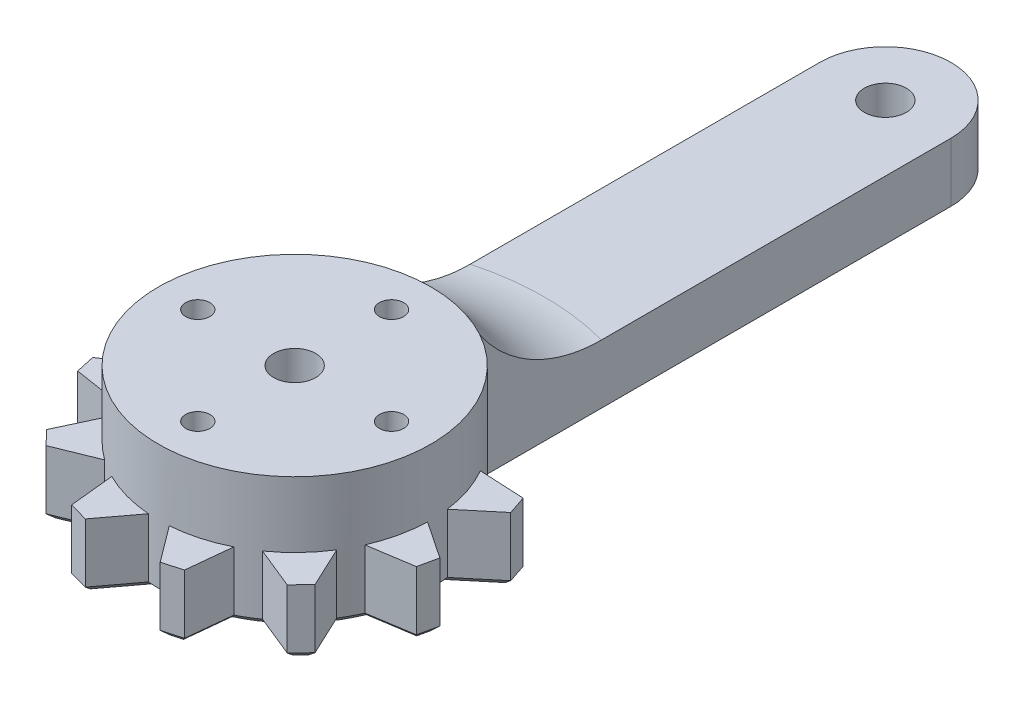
ISO-10303-21;
HEADER;
FILE_DESCRIPTION(('STEP AP214'),'2;1');
FILE_NAME('part.step','',(''),(''),'','','');
FILE_SCHEMA(('AUTOMOTIVE_DESIGN { 1 0 10303 214 1 1 1 1 }'));
ENDSEC;
DATA;
#1=APPLICATION_CONTEXT('core data for automotive mechanical design processes');
#2=APPLICATION_PROTOCOL_DEFINITION('international standard','automotive_design',2000,#1);
#3=PRODUCT_CONTEXT('',#1,'mechanical');
#4=PRODUCT('Part','Part','',(#3));
#5=PRODUCT_RELATED_PRODUCT_CATEGORY('part','',(#4));
#6=PRODUCT_DEFINITION_FORMATION('','',#4);
#7=PRODUCT_DEFINITION_CONTEXT('part definition',#1,'design');
#8=PRODUCT_DEFINITION('design','',#6,#7);
#9=PRODUCT_DEFINITION_SHAPE('','',#8);
#10=(LENGTH_UNIT() NAMED_UNIT(*) SI_UNIT(.MILLI.,.METRE.));
#11=(NAMED_UNIT(*) PLANE_ANGLE_UNIT() SI_UNIT($,.RADIAN.));
#12=(NAMED_UNIT(*) SI_UNIT($,.STERADIAN.) SOLID_ANGLE_UNIT());
#13=UNCERTAINTY_MEASURE_WITH_UNIT(LENGTH_MEASURE(1.E-05),#10,'distance_accuracy_value','');
#14=(GEOMETRIC_REPRESENTATION_CONTEXT(3) GLOBAL_UNCERTAINTY_ASSIGNED_CONTEXT((#13)) GLOBAL_UNIT_ASSIGNED_CONTEXT((#10,
#11,#12)) REPRESENTATION_CONTEXT('',''));
#15=CARTESIAN_POINT('',(0.,0.,0.));
#16=DIRECTION('',(0.,0.,1.));
#17=DIRECTION('',(1.,0.,0.));
#18=AXIS2_PLACEMENT_3D('',#15,#16,#17);
#19=CARTESIAN_POINT('',(0.,5.,0.));
#20=DIRECTION('',(0.,1.,0.));
#21=DIRECTION('',(0.,0.,1.));
#22=AXIS2_PLACEMENT_3D('',#19,#20,#21);
#23=PLANE('',#22);
#24=DIRECTION('',(0.600005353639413,0.,-0.79999598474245));
#25=VECTOR('',#24,1.);
#26=CARTESIAN_POINT('',(-2.85292663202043,5.,13.0938042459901));
#27=LINE('',#26,#25);
#28=CARTESIAN_POINT('',(-2.85292663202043,5.,13.0938042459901));
#29=VERTEX_POINT('',#28);
#30=CARTESIAN_POINT('',(-0.794695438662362,5.,10.3495342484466));
#31=VERTEX_POINT('',#30);
#32=EDGE_CURVE('E637',#29,#31,#27,.T.);
#33=ORIENTED_EDGE('',*,*,#32,.T.);
#34=CARTESIAN_POINT('',(0.,5.,0.));
#35=DIRECTION('',(0.,1.,0.));
#36=DIRECTION('',(0.,0.,1.));
#37=AXIS2_PLACEMENT_3D('',#34,#35,#36);
#38=CIRCLE('',#37,10.38);
#39=CARTESIAN_POINT('',(-4.64921725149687,5.,9.28058074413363));
#40=VERTEX_POINT('',#39);
#41=EDGE_CURVE('E480',#40,#31,#38,.T.);
#42=ORIENTED_EDGE('',*,*,#41,.F.);
#43=DIRECTION('',(0.102276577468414,0.,0.994756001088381));
#44=VECTOR('',#43,1.);
#45=CARTESIAN_POINT('',(-4.29837231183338,5.,12.6929466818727));
#46=LINE('',#45,#44);
#47=CARTESIAN_POINT('',(-4.29837231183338,5.,12.6929466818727));
#48=VERTEX_POINT('',#47);
#49=EDGE_CURVE('E626',#40,#48,#46,.T.);
#50=ORIENTED_EDGE('',*,*,#49,.T.);
#51=DIRECTION('',(0.963630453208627,0.,0.267238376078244));
#52=VECTOR('',#51,1.);
#53=CARTESIAN_POINT('',(-4.29837231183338,5.,12.6929466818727));
#54=LINE('',#53,#52);
#55=EDGE_CURVE('E634',#48,#29,#54,.T.);
#56=ORIENTED_EDGE('',*,*,#55,.T.);
#57=EDGE_LOOP('',(#33,#42,#50,#56));
#58=FACE_BOUND('',#57,.T.);
#59=ADVANCED_FACE('F55',(#58),#23,.T.);
#60=DIRECTION('',(0.926333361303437,0.,-0.376704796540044));
#61=VECTOR('',#60,1.);
#62=CARTESIAN_POINT('',(-9.18924315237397,5.,9.75421500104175));
#63=LINE('',#62,#61);
#64=CARTESIAN_POINT('',(-9.18924315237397,5.,9.75421500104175));
#65=VERTEX_POINT('',#64);
#66=CARTESIAN_POINT('',(-6.01159113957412,5.,8.46198392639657));
#67=VERTEX_POINT('',#66);
#68=EDGE_CURVE('E620',#65,#67,#63,.T.);
#69=ORIENTED_EDGE('',*,*,#68,.T.);
#70=CARTESIAN_POINT('',(-8.76500944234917,5.,5.56048644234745));
#71=VERTEX_POINT('',#70);
#72=EDGE_CURVE('E488',#71,#67,#38,.T.);
#73=ORIENTED_EDGE('',*,*,#72,.F.);
#74=DIRECTION('',(-0.424669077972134,0.,0.905348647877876));
#75=VECTOR('',#74,1.);
#76=CARTESIAN_POINT('',(-10.2217750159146,5.,8.66615344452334));
#77=LINE('',#76,#75);
#78=CARTESIAN_POINT('',(-10.2217750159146,5.,8.66615344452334));
#79=VERTEX_POINT('',#78);
#80=EDGE_CURVE('E609',#71,#79,#77,.T.);
#81=ORIENTED_EDGE('',*,*,#80,.T.);
#82=DIRECTION('',(0.688354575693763,0.,0.725374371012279));
#83=VECTOR('',#82,1.);
#84=CARTESIAN_POINT('',(-10.2217750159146,5.,8.66615344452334));
#85=LINE('',#84,#83);
#86=EDGE_CURVE('E617',#79,#65,#85,.T.);
#87=ORIENTED_EDGE('',*,*,#86,.T.);
#88=EDGE_LOOP('',(#69,#73,#81,#87));
#89=FACE_BOUND('',#88,.T.);
#90=ADVANCED_FACE('F860',(#89),#23,.T.);
#91=DIRECTION('',(0.988039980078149,0.,0.154197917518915));
#92=VECTOR('',#91,1.);
#93=CARTESIAN_POINT('',(-12.9005108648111,5.,3.62818403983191));
#94=LINE('',#93,#92);
#95=CARTESIAN_POINT('',(-12.9005108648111,5.,3.62818403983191));
#96=VERTEX_POINT('',#95);
#97=CARTESIAN_POINT('',(-9.5111832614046,5.,4.1571375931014));
#98=VERTEX_POINT('',#97);
#99=EDGE_CURVE('E603',#96,#98,#94,.T.);
#100=ORIENTED_EDGE('',*,*,#99,.T.);
#101=CARTESIAN_POINT('',(-10.3769417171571,5.,0.251953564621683));
#102=VERTEX_POINT('',#101);
#103=EDGE_CURVE('E492',#102,#98,#38,.T.);
#104=ORIENTED_EDGE('',*,*,#103,.F.);
#105=DIRECTION('',(-0.830301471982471,0.,0.55731451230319));
#106=VECTOR('',#105,1.);
#107=CARTESIAN_POINT('',(-13.2251702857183,5.,2.16374002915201));
#108=LINE('',#107,#106);
#109=CARTESIAN_POINT('',(-13.2251702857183,5.,2.16374002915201));
#110=VERTEX_POINT('',#109);
#111=EDGE_CURVE('E592',#102,#110,#108,.T.);
#112=ORIENTED_EDGE('',*,*,#111,.T.);
#113=DIRECTION('',(0.216439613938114,0.,0.976296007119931));
#114=VECTOR('',#113,1.);
#115=CARTESIAN_POINT('',(-13.2251702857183,5.,2.16374002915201));
#116=LINE('',#115,#114);
#117=EDGE_CURVE('E600',#110,#96,#116,.T.);
#118=ORIENTED_EDGE('',*,*,#117,.T.);
#119=EDGE_LOOP('',(#100,#104,#112,#118));
#120=FACE_BOUND('',#119,.T.);
#121=ADVANCED_FACE('F865',(#120),#23,.T.);
#122=DIRECTION('',(0.767497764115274,0.,0.641051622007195));
#123=VECTOR('',#122,1.);
#124=CARTESIAN_POINT('',(-12.9265489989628,5.,-3.53429356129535));
#125=LINE('',#124,#123);
#126=CARTESIAN_POINT('',(-12.9265489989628,5.,-3.53429356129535));
#127=VERTEX_POINT('',#126);
#128=CARTESIAN_POINT('',(-10.2937594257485,5.,-1.33525910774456));
#129=VERTEX_POINT('',#128);
#130=EDGE_CURVE('E586',#127,#129,#125,.T.);
#131=ORIENTED_EDGE('',*,*,#130,.T.);
#132=CARTESIAN_POINT('',(-9.02454080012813,5.,-5.12855372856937));
#133=VERTEX_POINT('',#132);
#134=EDGE_CURVE('E1612',#133,#129,#38,.T.);
#135=ORIENTED_EDGE('',*,*,#134,.F.);
#136=DIRECTION('',(-0.998745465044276,0.,0.0500749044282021));
#137=VECTOR('',#136,1.);
#138=CARTESIAN_POINT('',(-12.4505920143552,5.,-4.95677904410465));
#139=LINE('',#138,#137);
#140=CARTESIAN_POINT('',(-12.4505920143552,5.,-4.95677904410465));
#141=VERTEX_POINT('',#140);
#142=EDGE_CURVE('E575',#133,#141,#139,.T.);
#143=ORIENTED_EDGE('',*,*,#142,.T.);
#144=DIRECTION('',(-0.317304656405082,0.,0.948323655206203));
#145=VECTOR('',#144,1.);
#146=CARTESIAN_POINT('',(-12.4505920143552,5.,-4.95677904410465));
#147=LINE('',#146,#145);
#148=EDGE_CURVE('E583',#141,#127,#147,.T.);
#149=ORIENTED_EDGE('',*,*,#148,.T.);
#150=EDGE_LOOP('',(#131,#135,#143,#149));
#151=FACE_BOUND('',#150,.T.);
#152=ADVANCED_FACE('F1627',(#151),#23,.T.);
#153=DIRECTION('',(0.327707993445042,0.,0.94477905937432));
#154=VECTOR('',#153,1.);
#155=CARTESIAN_POINT('',(-9.25991936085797,5.,-9.68714578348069));
#156=LINE('',#155,#154);
#157=CARTESIAN_POINT('',(-9.25991936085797,5.,-9.68714578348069));
#158=VERTEX_POINT('',#157);
#159=CARTESIAN_POINT('',(-8.13576470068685,5.,-6.44621848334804));
#160=VERTEX_POINT('',#159);
#161=EDGE_CURVE('E569',#158,#160,#156,.T.);
#162=ORIENTED_EDGE('',*,*,#161,.T.);
#163=CARTESIAN_POINT('',(-5.09414083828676,5.,-9.0440106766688));
#164=VERTEX_POINT('',#163);
#165=EDGE_CURVE('E1610',#164,#160,#38,.T.);
#166=ORIENTED_EDGE('',*,*,#165,.F.);
#167=DIRECTION('',(-0.881882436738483,0.,-0.471469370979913));
#168=VECTOR('',#167,1.);
#169=CARTESIAN_POINT('',(-8.11931041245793,5.,-10.661317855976));
#170=LINE('',#169,#168);
#171=CARTESIAN_POINT('',(-8.11931041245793,5.,-10.661317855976));
#172=VERTEX_POINT('',#171);
#173=EDGE_CURVE('E459',#164,#172,#170,.T.);
#174=ORIENTED_EDGE('',*,*,#173,.T.);
#175=DIRECTION('',(-0.760405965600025,0.,0.649448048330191));
#176=VECTOR('',#175,1.);
#177=CARTESIAN_POINT('',(-8.11931041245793,5.,-10.661317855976));
#178=LINE('',#177,#176);
#179=EDGE_CURVE('E566',#172,#158,#178,.T.);
#180=ORIENTED_EDGE('',*,*,#179,.T.);
#181=EDGE_LOOP('',(#162,#166,#174,#180));
#182=FACE_BOUND('',#181,.T.);
#183=ADVANCED_FACE('F1608',(#182),#23,.T.);
#184=CARTESIAN_POINT('',(0.,5.,-45.));
#185=DIRECTION('',(0.,1.,0.));
#186=DIRECTION('',(0.,0.,1.));
#187=AXIS2_PLACEMENT_3D('',#184,#185,#186);
#188=CIRCLE('',#187,1.6);
#189=CARTESIAN_POINT('',(0.,5.,-43.4));
#190=VERTEX_POINT('',#189);
#191=EDGE_CURVE('E655',#190,#190,#188,.T.);
#192=ORIENTED_EDGE('',*,*,#191,.F.);
#193=EDGE_LOOP('',(#192));
#194=FACE_BOUND('',#193,.T.);
#195=DIRECTION('',(0.,0.,-1.));
#196=VECTOR('',#195,1.);
#197=CARTESIAN_POINT('',(-5.,5.,0.));
#198=LINE('',#197,#196);
#199=CARTESIAN_POINT('',(-5.,5.,-18.3720242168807));
#200=VERTEX_POINT('',#199);
#201=CARTESIAN_POINT('',(-5.,5.,-45.));
#202=VERTEX_POINT('',#201);
#203=EDGE_CURVE('E643',#200,#202,#198,.T.);
#204=ORIENTED_EDGE('',*,*,#203,.F.);
#205=CARTESIAN_POINT('',(0.,5.,0.));
#206=DIRECTION('',(0.,1.,0.));
#207=DIRECTION('',(0.,0.,1.));
#208=AXIS2_PLACEMENT_3D('',#205,#206,#207);
#209=CIRCLE('',#208,19.0402540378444);
#210=CARTESIAN_POINT('',(5.,5.,-18.3720242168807));
#211=VERTEX_POINT('',#210);
#212=EDGE_CURVE('E678',#200,#211,#209,.F.);
#213=ORIENTED_EDGE('',*,*,#212,.T.);
#214=DIRECTION('',(0.,0.,-1.));
#215=VECTOR('',#214,1.);
#216=CARTESIAN_POINT('',(5.,5.,0.));
#217=LINE('',#216,#215);
#218=CARTESIAN_POINT('',(5.,5.,-45.));
#219=VERTEX_POINT('',#218);
#220=EDGE_CURVE('E650',#211,#219,#217,.T.);
#221=ORIENTED_EDGE('',*,*,#220,.T.);
#222=CARTESIAN_POINT('',(0.,5.,-45.));
#223=DIRECTION('',(0.,1.,0.));
#224=DIRECTION('',(0.,0.,1.));
#225=AXIS2_PLACEMENT_3D('',#222,#223,#224);
#226=CIRCLE('',#225,5.);
#227=EDGE_CURVE('E652',#219,#202,#226,.T.);
#228=ORIENTED_EDGE('',*,*,#227,.T.);
#229=EDGE_LOOP('',(#204,#213,#221,#228));
#230=FACE_BOUND('',#229,.T.);
#231=ADVANCED_FACE('F1487',(#194,#230),#23,.T.);
#232=DIRECTION('',(-0.998745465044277,0.,-0.0500749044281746));
#233=VECTOR('',#232,1.);
#234=CARTESIAN_POINT('',(12.450592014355,5.,-4.95677904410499));
#235=LINE('',#234,#233);
#236=CARTESIAN_POINT('',(12.450592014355,5.,-4.95677904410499));
#237=VERTEX_POINT('',#236);
#238=CARTESIAN_POINT('',(9.02454080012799,5.,-5.12855372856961));
#239=VERTEX_POINT('',#238);
#240=EDGE_CURVE('E512',#237,#239,#235,.T.);
#241=ORIENTED_EDGE('',*,*,#240,.T.);
#242=CARTESIAN_POINT('',(10.2937594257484,5.,-1.33525910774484));
#243=VERTEX_POINT('',#242);
#244=EDGE_CURVE('E1456',#243,#239,#38,.T.);
#245=ORIENTED_EDGE('',*,*,#244,.F.);
#246=DIRECTION('',(0.767497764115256,0.,-0.641051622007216));
#247=VECTOR('',#246,1.);
#248=CARTESIAN_POINT('',(12.9265489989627,5.,-3.5342935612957));
#249=LINE('',#248,#247);
#250=CARTESIAN_POINT('',(12.9265489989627,5.,-3.5342935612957));
#251=VERTEX_POINT('',#250);
#252=EDGE_CURVE('E503',#243,#251,#249,.T.);
#253=ORIENTED_EDGE('',*,*,#252,.T.);
#254=DIRECTION('',(-0.317304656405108,0.,-0.948323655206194));
#255=VECTOR('',#254,1.);
#256=CARTESIAN_POINT('',(12.9265489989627,5.,-3.5342935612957));
#257=LINE('',#256,#255);
#258=EDGE_CURVE('E507',#251,#237,#257,.T.);
#259=ORIENTED_EDGE('',*,*,#258,.T.);
#260=EDGE_LOOP('',(#241,#245,#253,#259));
#261=FACE_BOUND('',#260,.T.);
#262=ADVANCED_FACE('F1645',(#261),#23,.T.);
#263=DIRECTION('',(-0.830301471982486,0.,-0.557314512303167));
#264=VECTOR('',#263,1.);
#265=CARTESIAN_POINT('',(13.2251702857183,5.,2.16374002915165));
#266=LINE('',#265,#264);
#267=CARTESIAN_POINT('',(13.2251702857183,5.,2.16374002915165));
#268=VERTEX_POINT('',#267);
#269=CARTESIAN_POINT('',(10.3769417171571,5.,0.251953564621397));
#270=VERTEX_POINT('',#269);
#271=EDGE_CURVE('E531',#268,#270,#266,.T.);
#272=ORIENTED_EDGE('',*,*,#271,.T.);
#273=CARTESIAN_POINT('',(9.51118326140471,5.,4.15713759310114));
#274=VERTEX_POINT('',#273);
#275=EDGE_CURVE('E485',#274,#270,#38,.T.);
#276=ORIENTED_EDGE('',*,*,#275,.F.);
#277=DIRECTION('',(0.988039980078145,0.,-0.154197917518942));
#278=VECTOR('',#277,1.);
#279=CARTESIAN_POINT('',(12.9005108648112,5.,3.62818403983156));
#280=LINE('',#279,#278);
#281=CARTESIAN_POINT('',(12.9005108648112,5.,3.62818403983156));
#282=VERTEX_POINT('',#281);
#283=EDGE_CURVE('E520',#274,#282,#280,.T.);
#284=ORIENTED_EDGE('',*,*,#283,.T.);
#285=DIRECTION('',(0.216439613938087,0.,-0.976296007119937));
#286=VECTOR('',#285,1.);
#287=CARTESIAN_POINT('',(12.9005108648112,5.,3.62818403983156));
#288=LINE('',#287,#286);
#289=EDGE_CURVE('E528',#282,#268,#288,.T.);
#290=ORIENTED_EDGE('',*,*,#289,.T.);
#291=EDGE_LOOP('',(#272,#276,#284,#290));
#292=FACE_BOUND('',#291,.T.);
#293=ADVANCED_FACE('F1650',(#292),#23,.T.);
#294=DIRECTION('',(-0.424669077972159,0.,-0.905348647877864));
#295=VECTOR('',#294,1.);
#296=CARTESIAN_POINT('',(10.2217750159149,5.,8.66615344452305));
#297=LINE('',#296,#295);
#298=CARTESIAN_POINT('',(10.2217750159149,5.,8.66615344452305));
#299=VERTEX_POINT('',#298);
#300=CARTESIAN_POINT('',(8.76500944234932,5.,5.56048644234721));
#301=VERTEX_POINT('',#300);
#302=EDGE_CURVE('E548',#299,#301,#297,.T.);
#303=ORIENTED_EDGE('',*,*,#302,.T.);
#304=CARTESIAN_POINT('',(6.01159113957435,5.,8.4619839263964));
#305=VERTEX_POINT('',#304);
#306=EDGE_CURVE('E478',#305,#301,#38,.T.);
#307=ORIENTED_EDGE('',*,*,#306,.F.);
#308=DIRECTION('',(0.926333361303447,0.,0.376704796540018));
#309=VECTOR('',#308,1.);
#310=CARTESIAN_POINT('',(9.18924315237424,5.,9.7542150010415));
#311=LINE('',#310,#309);
#312=CARTESIAN_POINT('',(9.18924315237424,5.,9.7542150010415));
#313=VERTEX_POINT('',#312);
#314=EDGE_CURVE('E537',#305,#313,#311,.T.);
#315=ORIENTED_EDGE('',*,*,#314,.T.);
#316=DIRECTION('',(0.688354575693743,0.,-0.725374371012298));
#317=VECTOR('',#316,1.);
#318=CARTESIAN_POINT('',(9.18924315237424,5.,9.7542150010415));
#319=LINE('',#318,#317);
#320=EDGE_CURVE('E545',#313,#299,#319,.T.);
#321=ORIENTED_EDGE('',*,*,#320,.T.);
#322=EDGE_LOOP('',(#303,#307,#315,#321));
#323=FACE_BOUND('',#322,.T.);
#324=ADVANCED_FACE('F702',(#323),#23,.T.);
#325=CARTESIAN_POINT('',(-5.,5.,0.));
#326=DIRECTION('',(-1.,0.,0.));
#327=DIRECTION('',(0.,0.,1.));
#328=AXIS2_PLACEMENT_3D('',#325,#326,#327);
#329=PLANE('',#328);
#330=DIRECTION('',(0.,-1.,0.));
#331=VECTOR('',#330,1.);
#332=CARTESIAN_POINT('',(-5.,5.,-45.));
#333=LINE('',#332,#331);
#334=CARTESIAN_POINT('',(-5.,0.5,-45.));
#335=VERTEX_POINT('',#334);
#336=EDGE_CURVE('E658',#202,#335,#333,.T.);
#337=ORIENTED_EDGE('',*,*,#336,.T.);
#338=DIRECTION('',(0.,0.,1.));
#339=VECTOR('',#338,1.);
#340=CARTESIAN_POINT('',(-5.,0.5,-9.09639489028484));
#341=LINE('',#340,#339);
#342=CARTESIAN_POINT('',(-5.,0.5,-9.09639489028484));
#343=VERTEX_POINT('',#342);
#344=EDGE_CURVE('E11',#335,#343,#341,.T.);
#345=ORIENTED_EDGE('',*,*,#344,.T.);
#346=DIRECTION('',(0.,-1.,0.));
#347=VECTOR('',#346,1.);
#348=CARTESIAN_POINT('',(-5.,5.,-9.09639489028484));
#349=LINE('',#348,#347);
#350=CARTESIAN_POINT('',(-5.,10.,-9.09639489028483));
#351=VERTEX_POINT('',#350);
#352=EDGE_CURVE('E664',#351,#343,#349,.T.);
#353=ORIENTED_EDGE('',*,*,#352,.F.);
#354=CARTESIAN_POINT('',(-5.,10.,-9.09639489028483));
#355=CARTESIAN_POINT('',(-5.,9.75482474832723,-9.25794247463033));
#356=CARTESIAN_POINT('',(-5.,9.51650365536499,-9.42977447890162));
#357=CARTESIAN_POINT('',(-5.,9.05473396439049,-9.79222079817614));
#358=CARTESIAN_POINT('',(-5.,8.83127974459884,-9.98282794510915));
#359=CARTESIAN_POINT('',(-5.,8.40034423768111,-10.3810485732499));
#360=CARTESIAN_POINT('',(-5.,8.19285380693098,-10.5886521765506));
#361=CARTESIAN_POINT('',(-5.,7.79469117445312,-11.0194463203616));
#362=CARTESIAN_POINT('',(-5.,7.60402126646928,-11.2426389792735));
#363=CARTESIAN_POINT('',(-5.,7.23090583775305,-11.7153019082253));
#364=CARTESIAN_POINT('',(-5.,7.04942925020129,-11.9655377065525));
#365=CARTESIAN_POINT('',(-5.,6.70741051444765,-12.4799306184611));
#366=CARTESIAN_POINT('',(-5.,6.54686874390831,-12.744087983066));
#367=CARTESIAN_POINT('',(-5.,6.24781035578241,-13.2846490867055));
#368=CARTESIAN_POINT('',(-5.,6.10929725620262,-13.5610547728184));
#369=CARTESIAN_POINT('',(-5.,5.85544543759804,-14.1241646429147));
#370=CARTESIAN_POINT('',(-5.,5.74009629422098,-14.4108641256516));
#371=CARTESIAN_POINT('',(-5.,5.53251441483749,-14.9955172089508));
#372=CARTESIAN_POINT('',(-5.,5.44050580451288,-15.2935504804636));
#373=CARTESIAN_POINT('',(-5.,5.28190579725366,-15.8962988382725));
#374=CARTESIAN_POINT('',(-5.,5.21531341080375,-16.2010136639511));
#375=CARTESIAN_POINT('',(-5.,5.10820847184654,-16.8155615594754));
#376=CARTESIAN_POINT('',(-5.,5.06774238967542,-17.1254027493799));
#377=CARTESIAN_POINT('',(-5.,5.01361723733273,-17.7474927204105));
#378=CARTESIAN_POINT('',(-5.,4.99996503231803,-18.0597420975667));
#379=CARTESIAN_POINT('',(-5.,5.,-18.3720242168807));
#380=B_SPLINE_CURVE_WITH_KNOTS('',3,(#354,#355,#356,#357,#358,#359,#360,#361,#362,#363,#364,
#365,#366,#367,#368,#369,#370,#371,#372,#373,#374,#375,#376,#377,#378,#379),.UNSPECIFIED.,.F.,
.F.,(4,2,2,2,2,2,2,2,2,2,2,2,4),(0.,0.880485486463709,1.76063611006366,2.64027879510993,
3.52004124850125,4.44635213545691,5.37267973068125,6.29915511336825,7.22521262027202,
8.15985190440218,9.09445479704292,10.0307155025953,10.9672158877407),.UNSPECIFIED.);
#381=EDGE_CURVE('E680',#351,#200,#380,.T.);
#382=ORIENTED_EDGE('',*,*,#381,.T.);
#383=ORIENTED_EDGE('',*,*,#203,.T.);
#384=EDGE_LOOP('',(#337,#345,#353,#382,#383));
#385=FACE_BOUND('',#384,.T.);
#386=ADVANCED_FACE('F698',(#385),#329,.T.);
#387=CARTESIAN_POINT('',(0.,5.,0.));
#388=DIRECTION('',(0.,-1.,0.));
#389=DIRECTION('',(0.,0.,-1.));
#390=AXIS2_PLACEMENT_3D('',#387,#388,#389);
#391=CYLINDRICAL_SURFACE('',#390,10.38);
#392=ORIENTED_EDGE('',*,*,#352,.T.);
#393=CARTESIAN_POINT('',(0.,0.5,0.));
#394=DIRECTION('',(0.,1.,0.));
#395=DIRECTION('',(0.,0.,1.));
#396=AXIS2_PLACEMENT_3D('',#393,#394,#395);
#397=CIRCLE('',#396,10.38);
#398=CARTESIAN_POINT('',(-5.09414083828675,0.5,-9.04401067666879));
#399=VERTEX_POINT('',#398);
#400=EDGE_CURVE('E1393',#343,#399,#397,.T.);
#401=ORIENTED_EDGE('',*,*,#400,.T.);
#402=DIRECTION('',(0.,1.,0.));
#403=VECTOR('',#402,1.);
#404=CARTESIAN_POINT('',(-5.09414083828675,-5.92627820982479,-9.04401067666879));
#405=LINE('',#404,#403);
#406=EDGE_CURVE('E573',#399,#164,#405,.T.);
#407=ORIENTED_EDGE('',*,*,#406,.T.);
#408=ORIENTED_EDGE('',*,*,#165,.T.);
#409=DIRECTION('',(0.,1.,0.));
#410=VECTOR('',#409,1.);
#411=CARTESIAN_POINT('',(-8.13576470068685,-5.92627820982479,-6.44621848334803));
#412=LINE('',#411,#410);
#413=CARTESIAN_POINT('',(-8.13576470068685,0.5,-6.44621848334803));
#414=VERTEX_POINT('',#413);
#415=EDGE_CURVE('E576',#414,#160,#412,.T.);
#416=ORIENTED_EDGE('',*,*,#415,.F.);
#417=CARTESIAN_POINT('',(0.,0.5,0.));
#418=DIRECTION('',(0.,1.,0.));
#419=DIRECTION('',(0.,0.,1.));
#420=AXIS2_PLACEMENT_3D('',#417,#418,#419);
#421=CIRCLE('',#420,10.38);
#422=CARTESIAN_POINT('',(-9.02454080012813,0.5,-5.12855372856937));
#423=VERTEX_POINT('',#422);
#424=EDGE_CURVE('E1391',#414,#423,#421,.T.);
#425=ORIENTED_EDGE('',*,*,#424,.T.);
#426=DIRECTION('',(0.,1.,0.));
#427=VECTOR('',#426,1.);
#428=CARTESIAN_POINT('',(-9.02454080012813,-5.44194377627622,-5.12855372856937));
#429=LINE('',#428,#427);
#430=EDGE_CURVE('E590',#423,#133,#429,.T.);
#431=ORIENTED_EDGE('',*,*,#430,.T.);
#432=ORIENTED_EDGE('',*,*,#134,.T.);
#433=DIRECTION('',(0.,1.,0.));
#434=VECTOR('',#433,1.);
#435=CARTESIAN_POINT('',(-10.2937594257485,-5.44194377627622,-1.33525910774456));
#436=LINE('',#435,#434);
#437=CARTESIAN_POINT('',(-10.2937594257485,0.5,-1.33525910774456));
#438=VERTEX_POINT('',#437);
#439=EDGE_CURVE('E593',#438,#129,#436,.T.);
#440=ORIENTED_EDGE('',*,*,#439,.F.);
#441=CARTESIAN_POINT('',(0.,0.5,0.));
#442=DIRECTION('',(0.,1.,0.));
#443=DIRECTION('',(0.,0.,1.));
#444=AXIS2_PLACEMENT_3D('',#441,#442,#443);
#445=CIRCLE('',#444,10.38);
#446=CARTESIAN_POINT('',(-10.3769417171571,0.500000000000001,0.251953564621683));
#447=VERTEX_POINT('',#446);
#448=EDGE_CURVE('E1389',#438,#447,#445,.T.);
#449=ORIENTED_EDGE('',*,*,#448,.T.);
#450=DIRECTION('',(0.,1.,0.));
#451=VECTOR('',#450,1.);
#452=CARTESIAN_POINT('',(-10.3769417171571,-5.38926357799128,0.251953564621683));
#453=LINE('',#452,#451);
#454=EDGE_CURVE('E607',#447,#102,#453,.T.);
#455=ORIENTED_EDGE('',*,*,#454,.T.);
#456=ORIENTED_EDGE('',*,*,#103,.T.);
#457=DIRECTION('',(0.,1.,0.));
#458=VECTOR('',#457,1.);
#459=CARTESIAN_POINT('',(-9.5111832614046,-5.38926357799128,4.15713759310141));
#460=LINE('',#459,#458);
#461=CARTESIAN_POINT('',(-9.5111832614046,0.5,4.15713759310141));
#462=VERTEX_POINT('',#461);
#463=EDGE_CURVE('E610',#462,#98,#460,.T.);
#464=ORIENTED_EDGE('',*,*,#463,.F.);
#465=CARTESIAN_POINT('',(0.,0.5,0.));
#466=DIRECTION('',(0.,1.,0.));
#467=DIRECTION('',(0.,0.,1.));
#468=AXIS2_PLACEMENT_3D('',#465,#466,#467);
#469=CIRCLE('',#468,10.38);
#470=CARTESIAN_POINT('',(-8.76500944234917,0.5,5.56048644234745));
#471=VERTEX_POINT('',#470);
#472=EDGE_CURVE('E1387',#462,#471,#469,.T.);
#473=ORIENTED_EDGE('',*,*,#472,.T.);
#474=DIRECTION('',(0.,1.,0.));
#475=VECTOR('',#474,1.);
#476=CARTESIAN_POINT('',(-8.76500944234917,-5.94247486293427,5.56048644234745));
#477=LINE('',#476,#475);
#478=EDGE_CURVE('E624',#471,#71,#477,.T.);
#479=ORIENTED_EDGE('',*,*,#478,.T.);
#480=ORIENTED_EDGE('',*,*,#72,.T.);
#481=DIRECTION('',(0.,1.,0.));
#482=VECTOR('',#481,1.);
#483=CARTESIAN_POINT('',(-6.01159113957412,-5.94247486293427,8.46198392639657));
#484=LINE('',#483,#482);
#485=CARTESIAN_POINT('',(-6.01159113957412,0.5,8.46198392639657));
#486=VERTEX_POINT('',#485);
#487=EDGE_CURVE('E627',#486,#67,#484,.T.);
#488=ORIENTED_EDGE('',*,*,#487,.F.);
#489=CARTESIAN_POINT('',(0.,0.5,0.));
#490=DIRECTION('',(0.,1.,0.));
#491=DIRECTION('',(0.,0.,1.));
#492=AXIS2_PLACEMENT_3D('',#489,#490,#491);
#493=CIRCLE('',#492,10.38);
#494=CARTESIAN_POINT('',(-4.64921725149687,0.5,9.28058074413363));
#495=VERTEX_POINT('',#494);
#496=EDGE_CURVE('E882',#486,#495,#493,.T.);
#497=ORIENTED_EDGE('',*,*,#496,.T.);
#498=DIRECTION('',(0.,1.,0.));
#499=VECTOR('',#498,1.);
#500=CARTESIAN_POINT('',(-4.64921725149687,-5.42199334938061,9.28058074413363));
#501=LINE('',#500,#499);
#502=EDGE_CURVE('E641',#495,#40,#501,.T.);
#503=ORIENTED_EDGE('',*,*,#502,.T.);
#504=ORIENTED_EDGE('',*,*,#41,.T.);
#505=DIRECTION('',(0.,1.,0.));
#506=VECTOR('',#505,1.);
#507=CARTESIAN_POINT('',(-0.794695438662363,-5.42199334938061,10.3495342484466));
#508=LINE('',#507,#506);
#509=CARTESIAN_POINT('',(-0.794695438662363,0.5,10.3495342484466));
#510=VERTEX_POINT('',#509);
#511=EDGE_CURVE('E644',#510,#31,#508,.T.);
#512=ORIENTED_EDGE('',*,*,#511,.F.);
#513=CARTESIAN_POINT('',(0.,0.5,0.));
#514=DIRECTION('',(0.,1.,0.));
#515=DIRECTION('',(0.,0.,1.));
#516=AXIS2_PLACEMENT_3D('',#513,#514,#515);
#517=CIRCLE('',#516,10.38);
#518=CARTESIAN_POINT('',(0.794695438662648,0.5,10.3495342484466));
#519=VERTEX_POINT('',#518);
#520=EDGE_CURVE('E456',#510,#519,#517,.T.);
#521=ORIENTED_EDGE('',*,*,#520,.T.);
#522=DIRECTION('',(0.,1.,0.));
#523=VECTOR('',#522,1.);
#524=CARTESIAN_POINT('',(0.794695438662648,-5.42199334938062,10.3495342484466));
#525=LINE('',#524,#523);
#526=CARTESIAN_POINT('',(0.794695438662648,5.,10.3495342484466));
#527=VERTEX_POINT('',#526);
#528=EDGE_CURVE('E447',#519,#527,#525,.T.);
#529=ORIENTED_EDGE('',*,*,#528,.T.);
#530=CARTESIAN_POINT('',(4.64921725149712,5.,9.2805807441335));
#531=VERTEX_POINT('',#530);
#532=EDGE_CURVE('E453',#527,#531,#38,.T.);
#533=ORIENTED_EDGE('',*,*,#532,.T.);
#534=DIRECTION('',(0.,1.,0.));
#535=VECTOR('',#534,1.);
#536=CARTESIAN_POINT('',(4.64921725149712,-5.42199334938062,9.2805807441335));
#537=LINE('',#536,#535);
#538=CARTESIAN_POINT('',(4.64921725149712,0.5,9.2805807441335));
#539=VERTEX_POINT('',#538);
#540=EDGE_CURVE('E460',#539,#531,#537,.T.);
#541=ORIENTED_EDGE('',*,*,#540,.F.);
#542=CARTESIAN_POINT('',(0.,0.5,0.));
#543=DIRECTION('',(0.,1.,0.));
#544=DIRECTION('',(0.,0.,1.));
#545=AXIS2_PLACEMENT_3D('',#542,#543,#544);
#546=CIRCLE('',#545,10.38);
#547=CARTESIAN_POINT('',(6.01159113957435,0.500000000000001,8.4619839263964));
#548=VERTEX_POINT('',#547);
#549=EDGE_CURVE('E883',#539,#548,#546,.T.);
#550=ORIENTED_EDGE('',*,*,#549,.T.);
#551=DIRECTION('',(0.,1.,0.));
#552=VECTOR('',#551,1.);
#553=CARTESIAN_POINT('',(6.01159113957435,-5.94247486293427,8.4619839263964));
#554=LINE('',#553,#552);
#555=EDGE_CURVE('E471',#548,#305,#554,.T.);
#556=ORIENTED_EDGE('',*,*,#555,.T.);
#557=ORIENTED_EDGE('',*,*,#306,.T.);
#558=DIRECTION('',(0.,1.,0.));
#559=VECTOR('',#558,1.);
#560=CARTESIAN_POINT('',(8.76500944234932,-5.94247486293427,5.56048644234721));
#561=LINE('',#560,#559);
#562=CARTESIAN_POINT('',(8.76500944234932,0.5,5.56048644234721));
#563=VERTEX_POINT('',#562);
#564=EDGE_CURVE('E553',#563,#301,#561,.T.);
#565=ORIENTED_EDGE('',*,*,#564,.F.);
#566=CARTESIAN_POINT('',(0.,0.5,0.));
#567=DIRECTION('',(0.,1.,0.));
#568=DIRECTION('',(0.,0.,1.));
#569=AXIS2_PLACEMENT_3D('',#566,#567,#568);
#570=CIRCLE('',#569,10.38);
#571=CARTESIAN_POINT('',(9.51118326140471,0.5,4.15713759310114));
#572=VERTEX_POINT('',#571);
#573=EDGE_CURVE('E1383',#563,#572,#570,.T.);
#574=ORIENTED_EDGE('',*,*,#573,.T.);
#575=DIRECTION('',(0.,1.,0.));
#576=VECTOR('',#575,1.);
#577=CARTESIAN_POINT('',(9.51118326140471,-5.38926357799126,4.15713759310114));
#578=LINE('',#577,#576);
#579=EDGE_CURVE('E535',#572,#274,#578,.T.);
#580=ORIENTED_EDGE('',*,*,#579,.T.);
#581=ORIENTED_EDGE('',*,*,#275,.T.);
#582=DIRECTION('',(0.,1.,0.));
#583=VECTOR('',#582,1.);
#584=CARTESIAN_POINT('',(10.3769417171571,-5.38926357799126,0.251953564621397));
#585=LINE('',#584,#583);
#586=CARTESIAN_POINT('',(10.3769417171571,0.5,0.251953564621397));
#587=VERTEX_POINT('',#586);
#588=EDGE_CURVE('E538',#587,#270,#585,.T.);
#589=ORIENTED_EDGE('',*,*,#588,.F.);
#590=CARTESIAN_POINT('',(0.,0.5,0.));
#591=DIRECTION('',(0.,1.,0.));
#592=DIRECTION('',(0.,0.,1.));
#593=AXIS2_PLACEMENT_3D('',#590,#591,#592);
#594=CIRCLE('',#593,10.38);
#595=CARTESIAN_POINT('',(10.2937594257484,0.500000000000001,-1.33525910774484));
#596=VERTEX_POINT('',#595);
#597=EDGE_CURVE('E1381',#587,#596,#594,.T.);
#598=ORIENTED_EDGE('',*,*,#597,.T.);
#599=DIRECTION('',(0.,1.,0.));
#600=VECTOR('',#599,1.);
#601=CARTESIAN_POINT('',(10.2937594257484,-5.44194377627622,-1.33525910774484));
#602=LINE('',#601,#600);
#603=EDGE_CURVE('E518',#596,#243,#602,.T.);
#604=ORIENTED_EDGE('',*,*,#603,.T.);
#605=ORIENTED_EDGE('',*,*,#244,.T.);
#606=DIRECTION('',(0.,1.,0.));
#607=VECTOR('',#606,1.);
#608=CARTESIAN_POINT('',(9.02454080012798,-5.44194377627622,-5.12855372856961));
#609=LINE('',#608,#607);
#610=CARTESIAN_POINT('',(9.02454080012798,0.5,-5.12855372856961));
#611=VERTEX_POINT('',#610);
#612=EDGE_CURVE('E521',#611,#239,#609,.T.);
#613=ORIENTED_EDGE('',*,*,#612,.F.);
#614=CARTESIAN_POINT('',(0.,0.5,0.));
#615=DIRECTION('',(0.,1.,0.));
#616=DIRECTION('',(0.,0.,1.));
#617=AXIS2_PLACEMENT_3D('',#614,#615,#616);
#618=CIRCLE('',#617,10.38);
#619=CARTESIAN_POINT('',(5.,0.5,-9.09639489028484));
#620=VERTEX_POINT('',#619);
#621=EDGE_CURVE('E1379',#611,#620,#618,.T.);
#622=ORIENTED_EDGE('',*,*,#621,.T.);
#623=DIRECTION('',(0.,-1.,0.));
#624=VECTOR('',#623,1.);
#625=CARTESIAN_POINT('',(5.,5.,-9.09639489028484));
#626=LINE('',#625,#624);
#627=CARTESIAN_POINT('',(5.,10.,-9.09639489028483));
#628=VERTEX_POINT('',#627);
#629=EDGE_CURVE('E662',#628,#620,#626,.T.);
#630=ORIENTED_EDGE('',*,*,#629,.F.);
#631=CARTESIAN_POINT('',(0.,10.,0.));
#632=DIRECTION('',(0.,1.,0.));
#633=DIRECTION('',(0.,0.,1.));
#634=AXIS2_PLACEMENT_3D('',#631,#632,#633);
#635=CIRCLE('',#634,10.38);
#636=EDGE_CURVE('E477',#351,#628,#635,.T.);
#637=ORIENTED_EDGE('',*,*,#636,.F.);
#638=EDGE_LOOP('',(#392,#401,#407,#408,#416,#425,#431,#432,#440,#449,#455,#456,#464,#473,#479,
#480,#488,#497,#503,#504,#512,#521,#529,#533,#541,#550,#556,#557,#565,#574,#580,#581,#589,#598,
#604,#605,#613,#622,#630,#637));
#639=FACE_BOUND('',#638,.T.);
#640=ADVANCED_FACE('F450',(#639),#391,.T.);
#641=CARTESIAN_POINT('',(5.,5.,0.));
#642=DIRECTION('',(-1.,0.,0.));
#643=DIRECTION('',(0.,0.,1.));
#644=AXIS2_PLACEMENT_3D('',#641,#642,#643);
#645=PLANE('',#644);
#646=ORIENTED_EDGE('',*,*,#629,.T.);
#647=DIRECTION('',(0.,0.,-1.));
#648=VECTOR('',#647,1.);
#649=CARTESIAN_POINT('',(5.,0.5,0.));
#650=LINE('',#649,#648);
#651=CARTESIAN_POINT('',(5.,0.5,-45.));
#652=VERTEX_POINT('',#651);
#653=EDGE_CURVE('E85',#620,#652,#650,.T.);
#654=ORIENTED_EDGE('',*,*,#653,.T.);
#655=DIRECTION('',(0.,-1.,0.));
#656=VECTOR('',#655,1.);
#657=CARTESIAN_POINT('',(5.,5.,-45.));
#658=LINE('',#657,#656);
#659=EDGE_CURVE('E660',#219,#652,#658,.T.);
#660=ORIENTED_EDGE('',*,*,#659,.F.);
#661=ORIENTED_EDGE('',*,*,#220,.F.);
#662=CARTESIAN_POINT('',(5.,5.,-18.3720242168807));
#663=CARTESIAN_POINT('',(5.,4.99996573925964,-18.0613214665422));
#664=CARTESIAN_POINT('',(5.,5.01347987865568,-17.750650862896));
#665=CARTESIAN_POINT('',(5.,5.06706087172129,-17.1316840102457));
#666=CARTESIAN_POINT('',(5.,5.10712085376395,-16.8233871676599));
#667=CARTESIAN_POINT('',(5.,5.2131593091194,-16.2118377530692));
#668=CARTESIAN_POINT('',(5.,5.27909337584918,-15.9085774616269));
#669=CARTESIAN_POINT('',(5.,5.43613587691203,-15.3086389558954));
#670=CARTESIAN_POINT('',(5.,5.52724545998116,-15.0119610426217));
#671=CARTESIAN_POINT('',(5.,5.73368324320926,-14.4274180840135));
#672=CARTESIAN_POINT('',(5.,5.84899280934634,-14.1395464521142));
#673=CARTESIAN_POINT('',(5.,6.10294381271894,-13.5741321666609));
#674=CARTESIAN_POINT('',(5.,6.24159590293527,-13.296594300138));
#675=CARTESIAN_POINT('',(5.,6.54110247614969,-12.7538264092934));
#676=CARTESIAN_POINT('',(5.,6.70195373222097,-12.4885946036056));
#677=CARTESIAN_POINT('',(5.,7.04474892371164,-11.9721331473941));
#678=CARTESIAN_POINT('',(5.,7.22669246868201,-11.7209032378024));
#679=CARTESIAN_POINT('',(5.,7.60053561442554,-11.2468093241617));
#680=CARTESIAN_POINT('',(5.,7.79142722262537,-11.0231497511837));
#681=CARTESIAN_POINT('',(5.,8.19009535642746,-10.5914673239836));
#682=CARTESIAN_POINT('',(5.,8.39786955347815,-10.3834423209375));
#683=CARTESIAN_POINT('',(5.,8.82942447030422,-9.98443642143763));
#684=CARTESIAN_POINT('',(5.,9.05321395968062,-9.79346499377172));
#685=CARTESIAN_POINT('',(5.,9.51570611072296,-9.43034963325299));
#686=CARTESIAN_POINT('',(5.,9.75441444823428,-9.25821293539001));
#687=CARTESIAN_POINT('',(5.,10.,-9.09639489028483));
#688=B_SPLINE_CURVE_WITH_KNOTS('',3,(#662,#663,#664,#665,#666,#667,#668,#669,#670,#671,#672,
#673,#674,#675,#676,#677,#678,#679,#680,#681,#682,#683,#684,#685,#686,#687),.UNSPECIFIED.,.F.,
.F.,(4,2,2,2,2,2,2,2,2,2,2,2,4),(0.,0.931767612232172,1.8632941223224,2.79322883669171,
3.72320599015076,4.65246967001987,5.58215859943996,6.51171252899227,7.44124925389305,
8.32250473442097,9.20363887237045,10.0852592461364,10.9672170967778),.UNSPECIFIED.);
#689=EDGE_CURVE('E688',#211,#628,#688,.T.);
#690=ORIENTED_EDGE('',*,*,#689,.T.);
#691=EDGE_LOOP('',(#646,#654,#660,#661,#690));
#692=FACE_BOUND('',#691,.T.);
#693=ADVANCED_FACE('F705',(#692),#645,.F.);
#694=CARTESIAN_POINT('',(0.,5.,-45.));
#695=DIRECTION('',(0.,-1.,0.));
#696=DIRECTION('',(0.,0.,-1.));
#697=AXIS2_PLACEMENT_3D('',#694,#695,#696);
#698=CYLINDRICAL_SURFACE('',#697,1.6);
#699=CARTESIAN_POINT('',(0.,0.499999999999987,-45.));
#700=DIRECTION('',(0.,1.,0.));
#701=DIRECTION('',(0.,0.,1.));
#702=AXIS2_PLACEMENT_3D('',#699,#700,#701);
#703=CIRCLE('',#702,1.6);
#704=CARTESIAN_POINT('',(0.,0.499999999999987,-43.4));
#705=VERTEX_POINT('',#704);
#706=EDGE_CURVE('E1376',#705,#705,#703,.F.);
#707=ORIENTED_EDGE('',*,*,#706,.T.);
#708=EDGE_LOOP('',(#707));
#709=FACE_BOUND('',#708,.T.);
#710=ORIENTED_EDGE('',*,*,#191,.T.);
#711=EDGE_LOOP('',(#710));
#712=FACE_BOUND('',#711,.T.);
#713=ADVANCED_FACE('F709',(#709,#712),#698,.F.);
#714=CARTESIAN_POINT('',(0.,5.,-45.));
#715=DIRECTION('',(0.,-1.,0.));
#716=DIRECTION('',(0.,0.,-1.));
#717=AXIS2_PLACEMENT_3D('',#714,#715,#716);
#718=CYLINDRICAL_SURFACE('',#717,5.);
#719=ORIENTED_EDGE('',*,*,#659,.T.);
#720=CARTESIAN_POINT('',(0.,0.5,-45.));
#721=DIRECTION('',(0.,1.,0.));
#722=DIRECTION('',(0.,0.,1.));
#723=AXIS2_PLACEMENT_3D('',#720,#721,#722);
#724=CIRCLE('',#723,5.);
#725=EDGE_CURVE('E70',#652,#335,#724,.T.);
#726=ORIENTED_EDGE('',*,*,#725,.T.);
#727=ORIENTED_EDGE('',*,*,#336,.F.);
#728=ORIENTED_EDGE('',*,*,#227,.F.);
#729=EDGE_LOOP('',(#719,#726,#727,#728));
#730=FACE_BOUND('',#729,.T.);
#731=ADVANCED_FACE('F710',(#730),#718,.T.);
#732=CARTESIAN_POINT('',(0.,5.,0.));
#733=DIRECTION('',(0.,-1.,0.));
#734=DIRECTION('',(0.,0.,-1.));
#735=AXIS2_PLACEMENT_3D('',#732,#733,#734);
#736=CYLINDRICAL_SURFACE('',#735,1.6);
#737=CARTESIAN_POINT('',(0.,0.500000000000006,0.));
#738=DIRECTION('',(0.,1.,0.));
#739=DIRECTION('',(0.,0.,1.));
#740=AXIS2_PLACEMENT_3D('',#737,#738,#739);
#741=CIRCLE('',#740,1.6);
#742=CARTESIAN_POINT('',(0.,0.500000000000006,1.6));
#743=VERTEX_POINT('',#742);
#744=EDGE_CURVE('E1373',#743,#743,#741,.F.);
#745=ORIENTED_EDGE('',*,*,#744,.T.);
#746=EDGE_LOOP('',(#745));
#747=FACE_BOUND('',#746,.T.);
#748=CARTESIAN_POINT('',(0.,10.,0.));
#749=DIRECTION('',(0.,1.,0.));
#750=DIRECTION('',(0.,0.,1.));
#751=AXIS2_PLACEMENT_3D('',#748,#749,#750);
#752=CIRCLE('',#751,1.6);
#753=CARTESIAN_POINT('',(0.,10.,1.6));
#754=VERTEX_POINT('',#753);
#755=EDGE_CURVE('E489',#754,#754,#752,.T.);
#756=ORIENTED_EDGE('',*,*,#755,.T.);
#757=EDGE_LOOP('',(#756));
#758=FACE_BOUND('',#757,.T.);
#759=ADVANCED_FACE('F713',(#747,#758),#736,.F.);
#760=DIRECTION('',(0.102276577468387,0.,-0.994756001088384));
#761=VECTOR('',#760,1.);
#762=CARTESIAN_POINT('',(4.29837231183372,5.,12.6929466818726));
#763=LINE('',#762,#761);
#764=CARTESIAN_POINT('',(4.29837231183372,5.,12.6929466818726));
#765=VERTEX_POINT('',#764);
#766=EDGE_CURVE('E476',#765,#531,#763,.T.);
#767=ORIENTED_EDGE('',*,*,#766,.T.);
#768=ORIENTED_EDGE('',*,*,#532,.F.);
#769=DIRECTION('',(0.600005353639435,0.,0.799995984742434));
#770=VECTOR('',#769,1.);
#771=CARTESIAN_POINT('',(2.85292663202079,5.,13.09380424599));
#772=LINE('',#771,#770);
#773=CARTESIAN_POINT('',(2.85292663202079,5.,13.09380424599));
#774=VERTEX_POINT('',#773);
#775=EDGE_CURVE('E463',#527,#774,#772,.T.);
#776=ORIENTED_EDGE('',*,*,#775,.T.);
#777=DIRECTION('',(0.963630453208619,0.,-0.267238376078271));
#778=VECTOR('',#777,1.);
#779=CARTESIAN_POINT('',(2.85292663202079,5.,13.09380424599));
#780=LINE('',#779,#778);
#781=EDGE_CURVE('E470',#774,#765,#780,.T.);
#782=ORIENTED_EDGE('',*,*,#781,.T.);
#783=EDGE_LOOP('',(#767,#768,#776,#782));
#784=FACE_BOUND('',#783,.T.);
#785=ADVANCED_FACE('F474',(#784),#23,.T.);
#786=CARTESIAN_POINT('',(0.,0.,0.));
#787=DIRECTION('',(0.,1.,0.));
#788=DIRECTION('',(0.,0.,1.));
#789=AXIS2_PLACEMENT_3D('',#786,#787,#788);
#790=PLANE('',#789);
#791=CARTESIAN_POINT('',(0.,0.,0.));
#792=DIRECTION('',(0.,1.,0.));
#793=DIRECTION('',(0.,0.,1.));
#794=AXIS2_PLACEMENT_3D('',#791,#792,#793);
#795=CIRCLE('',#794,2.10000000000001);
#796=CARTESIAN_POINT('',(0.,0.,2.10000000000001));
#797=VERTEX_POINT('',#796);
#798=EDGE_CURVE('E1370',#797,#797,#795,.T.);
#799=ORIENTED_EDGE('',*,*,#798,.T.);
#800=EDGE_LOOP('',(#799));
#801=FACE_BOUND('',#800,.T.);
#802=CARTESIAN_POINT('',(0.,0.,-45.));
#803=DIRECTION('',(0.,1.,0.));
#804=DIRECTION('',(0.,0.,1.));
#805=AXIS2_PLACEMENT_3D('',#802,#803,#804);
#806=CIRCLE('',#805,2.09999999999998);
#807=CARTESIAN_POINT('',(0.,0.,-42.9));
#808=VERTEX_POINT('',#807);
#809=EDGE_CURVE('E1367',#808,#808,#806,.T.);
#810=ORIENTED_EDGE('',*,*,#809,.T.);
#811=EDGE_LOOP('',(#810));
#812=FACE_BOUND('',#811,.T.);
#813=DIRECTION('',(0.881882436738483,0.,0.471469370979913));
#814=VECTOR('',#813,1.);
#815=CARTESIAN_POINT('',(-5.32987552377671,0.,-8.60306945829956));
#816=LINE('',#815,#814);
#817=CARTESIAN_POINT('',(-8.05408779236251,0.,-10.0594797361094));
#818=VERTEX_POINT('',#817);
#819=CARTESIAN_POINT('',(-5.08394772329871,0.,-8.47159226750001));
#820=VERTEX_POINT('',#819);
#821=EDGE_CURVE('E1362',#818,#820,#816,.T.);
#822=ORIENTED_EDGE('',*,*,#821,.T.);
#823=CARTESIAN_POINT('',(0.,0.,0.));
#824=DIRECTION('',(0.,1.,0.));
#825=DIRECTION('',(0.,0.,1.));
#826=AXIS2_PLACEMENT_3D('',#823,#824,#825);
#827=CIRCLE('',#826,9.88);
#828=CARTESIAN_POINT('',(-4.5,0.,-8.79570349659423));
#829=VERTEX_POINT('',#828);
#830=EDGE_CURVE('E1364',#820,#829,#827,.F.);
#831=ORIENTED_EDGE('',*,*,#830,.T.);
#832=DIRECTION('',(0.,0.,-1.));
#833=VECTOR('',#832,1.);
#834=CARTESIAN_POINT('',(-4.5,0.,-45.));
#835=LINE('',#834,#833);
#836=CARTESIAN_POINT('',(-4.5,0.,-45.));
#837=VERTEX_POINT('',#836);
#838=EDGE_CURVE('E1490',#829,#837,#835,.T.);
#839=ORIENTED_EDGE('',*,*,#838,.T.);
#840=CARTESIAN_POINT('',(0.,0.,-45.));
#841=DIRECTION('',(0.,1.,0.));
#842=DIRECTION('',(0.,0.,1.));
#843=AXIS2_PLACEMENT_3D('',#840,#841,#842);
#844=CIRCLE('',#843,4.5);
#845=CARTESIAN_POINT('',(4.5,0.,-45.));
#846=VERTEX_POINT('',#845);
#847=EDGE_CURVE('E1473',#837,#846,#844,.F.);
#848=ORIENTED_EDGE('',*,*,#847,.T.);
#849=DIRECTION('',(0.,0.,1.));
#850=VECTOR('',#849,1.);
#851=CARTESIAN_POINT('',(4.5,0.,0.));
#852=LINE('',#851,#850);
#853=CARTESIAN_POINT('',(4.5,0.,-8.79570349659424));
#854=VERTEX_POINT('',#853);
#855=EDGE_CURVE('E1466',#846,#854,#852,.T.);
#856=ORIENTED_EDGE('',*,*,#855,.T.);
#857=CARTESIAN_POINT('',(0.,0.,0.));
#858=DIRECTION('',(0.,1.,0.));
#859=DIRECTION('',(0.,0.,1.));
#860=AXIS2_PLACEMENT_3D('',#857,#858,#859);
#861=CIRCLE('',#860,9.88);
#862=CARTESIAN_POINT('',(8.72098631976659,0.,-4.64314522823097));
#863=VERTEX_POINT('',#862);
#864=EDGE_CURVE('E1462',#854,#863,#861,.F.);
#865=ORIENTED_EDGE('',*,*,#864,.T.);
#866=DIRECTION('',(0.998745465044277,0.,0.0500749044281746));
#867=VECTOR('',#866,1.);
#868=CARTESIAN_POINT('',(12.425554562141,0.,-4.45740631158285));
#869=LINE('',#868,#867);
#870=CARTESIAN_POINT('',(12.0847157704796,0.,-4.47449522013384));
#871=VERTEX_POINT('',#870);
#872=EDGE_CURVE('E1458',#863,#871,#869,.T.);
#873=ORIENTED_EDGE('',*,*,#872,.T.);
#874=DIRECTION('',(0.317304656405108,0.,0.948323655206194));
#875=VECTOR('',#874,1.);
#876=CARTESIAN_POINT('',(12.4523871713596,0.,-3.37564123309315));
#877=LINE('',#876,#875);
#878=CARTESIAN_POINT('',(12.344101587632,0.,-3.69927272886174));
#879=VERTEX_POINT('',#878);
#880=EDGE_CURVE('E1496',#871,#879,#877,.T.);
#881=ORIENTED_EDGE('',*,*,#880,.T.);
#882=DIRECTION('',(-0.767497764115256,0.,0.641051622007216));
#883=VECTOR('',#882,1.);
#884=CARTESIAN_POINT('',(9.97323361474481,0.,-1.71900798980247));
#885=LINE('',#884,#883);
#886=CARTESIAN_POINT('',(9.75920391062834,0.,-1.54023992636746));
#887=VERTEX_POINT('',#886);
#888=EDGE_CURVE('E1498',#879,#887,#885,.T.);
#889=ORIENTED_EDGE('',*,*,#888,.T.);
#890=CARTESIAN_POINT('',(0.,0.,0.));
#891=DIRECTION('',(0.,1.,0.));
#892=DIRECTION('',(0.,0.,1.));
#893=AXIS2_PLACEMENT_3D('',#890,#891,#892);
#894=CIRCLE('',#893,9.88);
#895=CARTESIAN_POINT('',(9.86674088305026,0.,0.511687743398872));
#896=VERTEX_POINT('',#895);
#897=EDGE_CURVE('E1500',#887,#896,#894,.F.);
#898=ORIENTED_EDGE('',*,*,#897,.T.);
#899=DIRECTION('',(0.830301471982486,0.,0.557314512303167));
#900=VECTOR('',#899,1.);
#901=CARTESIAN_POINT('',(12.9465130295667,0.,2.57889076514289));
#902=LINE('',#901,#900);
#903=CARTESIAN_POINT('',(12.6631586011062,0.,2.38869775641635));
#904=VERTEX_POINT('',#903);
#905=EDGE_CURVE('E1502',#896,#904,#902,.T.);
#906=ORIENTED_EDGE('',*,*,#905,.T.);
#907=DIRECTION('',(-0.216439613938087,0.,0.976296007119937));
#908=VECTOR('',#907,1.);
#909=CARTESIAN_POINT('',(12.4123628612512,0.,3.51996423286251));
#910=LINE('',#909,#908);
#911=CARTESIAN_POINT('',(12.4862265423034,0.,3.18678669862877));
#912=VERTEX_POINT('',#911);
#913=EDGE_CURVE('E1504',#904,#912,#910,.T.);
#914=ORIENTED_EDGE('',*,*,#913,.T.);
#915=DIRECTION('',(-0.988039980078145,0.,0.154197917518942));
#916=VECTOR('',#915,1.);
#917=CARTESIAN_POINT('',(9.43408430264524,0.,3.66311760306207));
#918=LINE('',#917,#916);
#919=CARTESIAN_POINT('',(9.15855267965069,0.,3.70611829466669));
#920=VERTEX_POINT('',#919);
#921=EDGE_CURVE('E1506',#912,#920,#918,.T.);
#922=ORIENTED_EDGE('',*,*,#921,.T.);
#923=CARTESIAN_POINT('',(0.,0.,0.));
#924=DIRECTION('',(0.,1.,0.));
#925=DIRECTION('',(0.,0.,1.));
#926=AXIS2_PLACEMENT_3D('',#923,#924,#925);
#927=CIRCLE('',#926,9.88);
#928=CARTESIAN_POINT('',(8.19390897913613,0.,5.52034923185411));
#929=VERTEX_POINT('',#928);
#930=EDGE_CURVE('E1508',#920,#929,#927,.F.);
#931=ORIENTED_EDGE('',*,*,#930,.T.);
#932=DIRECTION('',(0.424669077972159,0.,0.905348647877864));
#933=VECTOR('',#932,1.);
#934=CARTESIAN_POINT('',(9.76910069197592,0.,8.87848798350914));
#935=LINE('',#934,#933);
#936=CARTESIAN_POINT('',(9.62417518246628,0.,8.56952243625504));
#937=VERTEX_POINT('',#936);
#938=EDGE_CURVE('E1510',#929,#937,#935,.T.);
#939=ORIENTED_EDGE('',*,*,#938,.T.);
#940=DIRECTION('',(-0.688354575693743,0.,0.725374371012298));
#941=VECTOR('',#940,1.);
#942=CARTESIAN_POINT('',(8.82655596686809,0.,9.41003771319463));
#943=LINE('',#942,#941);
#944=CARTESIAN_POINT('',(9.06146861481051,0.,9.16249143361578));
#945=VERTEX_POINT('',#944);
#946=EDGE_CURVE('E1512',#937,#945,#943,.T.);
#947=ORIENTED_EDGE('',*,*,#946,.T.);
#948=DIRECTION('',(-0.926333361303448,0.,-0.376704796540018));
#949=VECTOR('',#948,1.);
#950=CARTESIAN_POINT('',(6.19994353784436,0.,7.99881724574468));
#951=LINE('',#950,#949);
#952=CARTESIAN_POINT('',(5.94161984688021,0.,7.89376675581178));
#953=VERTEX_POINT('',#952);
#954=EDGE_CURVE('E1514',#945,#953,#951,.T.);
#955=ORIENTED_EDGE('',*,*,#954,.T.);
#956=CARTESIAN_POINT('',(0.,0.,0.));
#957=DIRECTION('',(0.,1.,0.));
#958=DIRECTION('',(0.,0.,1.));
#959=AXIS2_PLACEMENT_3D('',#956,#957,#958);
#960=CIRCLE('',#959,9.88);
#961=CARTESIAN_POINT('',(4.18036080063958,0.,8.95203795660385));
#962=VERTEX_POINT('',#961);
#963=EDGE_CURVE('E1516',#953,#962,#960,.F.);
#964=ORIENTED_EDGE('',*,*,#963,.T.);
#965=DIRECTION('',(-0.102276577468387,0.,0.994756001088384));
#966=VECTOR('',#965,1.);
#967=CARTESIAN_POINT('',(3.80099431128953,0.,12.6418083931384));
#968=LINE('',#967,#966);
#969=CARTESIAN_POINT('',(3.83589792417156,0.,12.3023310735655));
#970=VERTEX_POINT('',#969);
#971=EDGE_CURVE('E1323',#962,#970,#968,.T.);
#972=ORIENTED_EDGE('',*,*,#971,.T.);
#973=DIRECTION('',(-0.963630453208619,0.,0.267238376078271));
#974=VECTOR('',#973,1.);
#975=CARTESIAN_POINT('',(2.71930744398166,0.,12.6119890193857));
#976=LINE('',#975,#974);
#977=CARTESIAN_POINT('',(3.04816264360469,0.,12.5207894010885));
#978=VERTEX_POINT('',#977);
#979=EDGE_CURVE('E1313',#970,#978,#976,.T.);
#980=ORIENTED_EDGE('',*,*,#979,.T.);
#981=DIRECTION('',(-0.600005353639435,0.,-0.799995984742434));
#982=VECTOR('',#981,1.);
#983=CARTESIAN_POINT('',(1.19469343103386,0.,10.0495315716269));
#984=LINE('',#983,#982);
#985=CARTESIAN_POINT('',(1.02737181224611,0.,9.8264391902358));
#986=VERTEX_POINT('',#985);
#987=EDGE_CURVE('E1318',#978,#986,#984,.T.);
#988=ORIENTED_EDGE('',*,*,#987,.T.);
#989=CARTESIAN_POINT('',(0.,0.,0.));
#990=DIRECTION('',(0.,1.,0.));
#991=DIRECTION('',(0.,0.,1.));
#992=AXIS2_PLACEMENT_3D('',#989,#990,#991);
#993=CIRCLE('',#992,9.88);
#994=CARTESIAN_POINT('',(-1.02737181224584,0.,9.82643919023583));
#995=VERTEX_POINT('',#994);
#996=EDGE_CURVE('E1320',#986,#995,#993,.F.);
#997=ORIENTED_EDGE('',*,*,#996,.T.);
#998=DIRECTION('',(-0.600005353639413,0.,0.79999598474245));
#999=VECTOR('',#998,1.);
#1000=CARTESIAN_POINT('',(-3.25292462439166,0.,12.7938015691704));
#1001=LINE('',#1000,#999);
#1002=CARTESIAN_POINT('',(-3.04816264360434,0.,12.5207894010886));
#1003=VERTEX_POINT('',#1002);
#1004=EDGE_CURVE('E889',#995,#1003,#1001,.T.);
#1005=ORIENTED_EDGE('',*,*,#1004,.T.);
#1006=DIRECTION('',(-0.963630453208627,0.,-0.267238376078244));
#1007=VECTOR('',#1006,1.);
#1008=CARTESIAN_POINT('',(-4.16475312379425,0.,12.2111314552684));
#1009=LINE('',#1008,#1007);
#1010=CARTESIAN_POINT('',(-3.83589792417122,0.,12.3023310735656));
#1011=VERTEX_POINT('',#1010);
#1012=EDGE_CURVE('E1328',#1003,#1011,#1009,.T.);
#1013=ORIENTED_EDGE('',*,*,#1012,.T.);
#1014=DIRECTION('',(-0.102276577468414,0.,-0.994756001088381));
#1015=VECTOR('',#1014,1.);
#1016=CARTESIAN_POINT('',(-4.15183925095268,0.,9.22944245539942));
#1017=LINE('',#1016,#1015);
#1018=CARTESIAN_POINT('',(-4.18036080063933,0.,8.95203795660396));
#1019=VERTEX_POINT('',#1018);
#1020=EDGE_CURVE('E1330',#1011,#1019,#1017,.T.);
#1021=ORIENTED_EDGE('',*,*,#1020,.T.);
#1022=CARTESIAN_POINT('',(0.,0.,0.));
#1023=DIRECTION('',(0.,1.,0.));
#1024=DIRECTION('',(0.,0.,1.));
#1025=AXIS2_PLACEMENT_3D('',#1022,#1023,#1024);
#1026=CIRCLE('',#1025,9.88);
#1027=CARTESIAN_POINT('',(-5.94161984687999,0.,7.89376675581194));
#1028=VERTEX_POINT('',#1027);
#1029=EDGE_CURVE('E1332',#1019,#1028,#1026,.F.);
#1030=ORIENTED_EDGE('',*,*,#1029,.T.);
#1031=DIRECTION('',(-0.926333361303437,0.,0.376704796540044));
#1032=VECTOR('',#1031,1.);
#1033=CARTESIAN_POINT('',(-9.37759555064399,0.,9.29104832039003));
#1034=LINE('',#1033,#1032);
#1035=CARTESIAN_POINT('',(-9.06146861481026,0.,9.16249143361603));
#1036=VERTEX_POINT('',#1035);
#1037=EDGE_CURVE('E1334',#1028,#1036,#1034,.T.);
#1038=ORIENTED_EDGE('',*,*,#1037,.T.);
#1039=DIRECTION('',(-0.688354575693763,0.,-0.725374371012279));
#1040=VECTOR('',#1039,1.);
#1041=CARTESIAN_POINT('',(-9.85908783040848,0.,8.32197615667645));
#1042=LINE('',#1041,#1040);
#1043=CARTESIAN_POINT('',(-9.62417518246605,0.,8.5695224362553));
#1044=VERTEX_POINT('',#1043);
#1045=EDGE_CURVE('E1336',#1036,#1044,#1042,.T.);
#1046=ORIENTED_EDGE('',*,*,#1045,.T.);
#1047=DIRECTION('',(0.424669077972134,0.,-0.905348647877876));
#1048=VECTOR('',#1047,1.);
#1049=CARTESIAN_POINT('',(-8.31233511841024,0.,5.77282098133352));
#1050=LINE('',#1049,#1048);
#1051=CARTESIAN_POINT('',(-8.19390897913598,0.,5.52034923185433));
#1052=VERTEX_POINT('',#1051);
#1053=EDGE_CURVE('E1338',#1044,#1052,#1050,.T.);
#1054=ORIENTED_EDGE('',*,*,#1053,.T.);
#1055=CARTESIAN_POINT('',(0.,0.,0.));
#1056=DIRECTION('',(0.,1.,0.));
#1057=DIRECTION('',(0.,0.,1.));
#1058=AXIS2_PLACEMENT_3D('',#1055,#1056,#1057);
#1059=CIRCLE('',#1058,9.88);
#1060=CARTESIAN_POINT('',(-9.15855267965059,0.,3.70611829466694));
#1061=VERTEX_POINT('',#1060);
#1062=EDGE_CURVE('E1340',#1052,#1061,#1059,.F.);
#1063=ORIENTED_EDGE('',*,*,#1062,.T.);
#1064=DIRECTION('',(-0.988039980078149,0.,-0.154197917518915));
#1065=VECTOR('',#1064,1.);
#1066=CARTESIAN_POINT('',(-12.8234119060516,0.,3.13416404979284));
#1067=LINE('',#1066,#1065);
#1068=CARTESIAN_POINT('',(-12.4862265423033,0.,3.18678669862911));
#1069=VERTEX_POINT('',#1068);
#1070=EDGE_CURVE('E1342',#1061,#1069,#1067,.T.);
#1071=ORIENTED_EDGE('',*,*,#1070,.T.);
#1072=DIRECTION('',(-0.216439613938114,0.,-0.976296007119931));
#1073=VECTOR('',#1072,1.);
#1074=CARTESIAN_POINT('',(-12.7370222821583,0.,2.05552022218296));
#1075=LINE('',#1074,#1073);
#1076=CARTESIAN_POINT('',(-12.6631586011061,0.,2.3886977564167));
#1077=VERTEX_POINT('',#1076);
#1078=EDGE_CURVE('E1344',#1069,#1077,#1075,.T.);
#1079=ORIENTED_EDGE('',*,*,#1078,.T.);
#1080=DIRECTION('',(0.830301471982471,0.,-0.55731451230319));
#1081=VECTOR('',#1080,1.);
#1082=CARTESIAN_POINT('',(-10.0982844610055,0.,0.66710430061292));
#1083=LINE('',#1082,#1081);
#1084=CARTESIAN_POINT('',(-9.86674088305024,0.,0.511687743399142));
#1085=VERTEX_POINT('',#1084);
#1086=EDGE_CURVE('E1346',#1077,#1085,#1083,.T.);
#1087=ORIENTED_EDGE('',*,*,#1086,.T.);
#1088=CARTESIAN_POINT('',(0.,0.,0.));
#1089=DIRECTION('',(0.,1.,0.));
#1090=DIRECTION('',(0.,0.,1.));
#1091=AXIS2_PLACEMENT_3D('',#1088,#1089,#1090);
#1092=CIRCLE('',#1091,9.88);
#1093=CARTESIAN_POINT('',(-9.75920391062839,0.,-1.54023992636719));
#1094=VERTEX_POINT('',#1093);
#1095=EDGE_CURVE('E1348',#1085,#1094,#1092,.F.);
#1096=ORIENTED_EDGE('',*,*,#1095,.T.);
#1097=DIRECTION('',(-0.767497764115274,0.,-0.641051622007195));
#1098=VECTOR('',#1097,1.);
#1099=CARTESIAN_POINT('',(-12.6060231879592,0.,-3.91804244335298));
#1100=LINE('',#1099,#1098);
#1101=CARTESIAN_POINT('',(-12.3441015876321,0.,-3.6992727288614));
#1102=VERTEX_POINT('',#1101);
#1103=EDGE_CURVE('E1350',#1094,#1102,#1100,.T.);
#1104=ORIENTED_EDGE('',*,*,#1103,.T.);
#1105=DIRECTION('',(0.317304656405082,0.,-0.948323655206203));
#1106=VECTOR('',#1105,1.);
#1107=CARTESIAN_POINT('',(-11.9764301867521,0.,-4.79812671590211));
#1108=LINE('',#1107,#1106);
#1109=CARTESIAN_POINT('',(-12.0847157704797,0.,-4.47449522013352));
#1110=VERTEX_POINT('',#1109);
#1111=EDGE_CURVE('E1352',#1102,#1110,#1108,.T.);
#1112=ORIENTED_EDGE('',*,*,#1111,.T.);
#1113=DIRECTION('',(0.998745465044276,0.,-0.0500749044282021));
#1114=VECTOR('',#1113,1.);
#1115=CARTESIAN_POINT('',(-8.99950334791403,0.,-4.62918099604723));
#1116=LINE('',#1115,#1114);
#1117=CARTESIAN_POINT('',(-8.72098631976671,0.,-4.64314522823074));
#1118=VERTEX_POINT('',#1117);
#1119=EDGE_CURVE('E1354',#1110,#1118,#1116,.T.);
#1120=ORIENTED_EDGE('',*,*,#1119,.T.);
#1121=CARTESIAN_POINT('',(0.,0.,0.));
#1122=DIRECTION('',(0.,1.,0.));
#1123=DIRECTION('',(0.,0.,1.));
#1124=AXIS2_PLACEMENT_3D('',#1121,#1122,#1123);
#1125=CIRCLE('',#1124,9.88);
#1126=CARTESIAN_POINT('',(-7.57198826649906,0.,-6.34660489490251));
#1127=VERTEX_POINT('',#1126);
#1128=EDGE_CURVE('E1356',#1118,#1127,#1125,.F.);
#1129=ORIENTED_EDGE('',*,*,#1128,.T.);
#1130=DIRECTION('',(-0.327707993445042,0.,-0.94477905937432));
#1131=VECTOR('',#1130,1.);
#1132=CARTESIAN_POINT('',(-8.78752983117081,0.,-9.85099978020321));
#1133=LINE('',#1132,#1131);
#1134=CARTESIAN_POINT('',(-8.67569393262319,0.,-9.52857793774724));
#1135=VERTEX_POINT('',#1134);
#1136=EDGE_CURVE('E1358',#1127,#1135,#1133,.T.);
#1137=ORIENTED_EDGE('',*,*,#1136,.T.);
#1138=DIRECTION('',(0.760405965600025,0.,-0.649448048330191));
#1139=VECTOR('',#1138,1.);
#1140=CARTESIAN_POINT('',(-7.79458638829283,0.,-10.281114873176));
#1141=LINE('',#1140,#1139);
#1142=EDGE_CURVE('E1360',#1135,#818,#1141,.T.);
#1143=ORIENTED_EDGE('',*,*,#1142,.T.);
#1144=EDGE_LOOP('',(#822,#831,#839,#848,#856,#865,#873,#881,#889,#898,#906,#914,#922,#931,#939,
#947,#955,#964,#972,#980,#988,#997,#1005,#1013,#1021,#1030,#1038,#1046,#1054,#1063,#1071,#1079,
#1087,#1096,#1104,#1112,#1120,#1129,#1137,#1143));
#1145=FACE_BOUND('',#1144,.T.);
#1146=ADVANCED_FACE('F720',(#801,#812,#1145),#790,.F.);
#1147=CARTESIAN_POINT('',(-4.29837231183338,-5.42199334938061,12.6929466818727));
#1148=DIRECTION('',(-0.994756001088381,0.,0.102276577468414));
#1149=DIRECTION('',(0.102276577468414,0.,0.994756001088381));
#1150=AXIS2_PLACEMENT_3D('',#1147,#1148,#1149);
#1151=PLANE('',#1150);
#1152=ORIENTED_EDGE('',*,*,#502,.F.);
#1153=DIRECTION('',(0.102276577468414,0.,0.994756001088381));
#1154=VECTOR('',#1153,1.);
#1155=CARTESIAN_POINT('',(-4.29837231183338,0.5,12.6929466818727));
#1156=LINE('',#1155,#1154);
#1157=CARTESIAN_POINT('',(-4.29837231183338,0.5,12.6929466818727));
#1158=VERTEX_POINT('',#1157);
#1159=EDGE_CURVE('E1420',#495,#1158,#1156,.T.);
#1160=ORIENTED_EDGE('',*,*,#1159,.T.);
#1161=DIRECTION('',(0.,1.,0.));
#1162=VECTOR('',#1161,1.);
#1163=CARTESIAN_POINT('',(-4.29837231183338,-5.42199334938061,12.6929466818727));
#1164=LINE('',#1163,#1162);
#1165=EDGE_CURVE('E640',#1158,#48,#1164,.T.);
#1166=ORIENTED_EDGE('',*,*,#1165,.T.);
#1167=ORIENTED_EDGE('',*,*,#49,.F.);
#1168=EDGE_LOOP('',(#1152,#1160,#1166,#1167));
#1169=FACE_BOUND('',#1168,.T.);
#1170=ADVANCED_FACE('F723',(#1169),#1151,.T.);
#1171=CARTESIAN_POINT('',(-2.85292663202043,-5.42199334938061,13.0938042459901));
#1172=DIRECTION('',(0.79999598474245,0.,0.600005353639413));
#1173=DIRECTION('',(0.600005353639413,0.,-0.79999598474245));
#1174=AXIS2_PLACEMENT_3D('',#1171,#1172,#1173);
#1175=PLANE('',#1174);
#1176=DIRECTION('',(0.,1.,0.));
#1177=VECTOR('',#1176,1.);
#1178=CARTESIAN_POINT('',(-2.85292663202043,-5.42199334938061,13.0938042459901));
#1179=LINE('',#1178,#1177);
#1180=CARTESIAN_POINT('',(-2.85292663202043,0.500000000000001,13.0938042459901));
#1181=VERTEX_POINT('',#1180);
#1182=EDGE_CURVE('E646',#1181,#29,#1179,.T.);
#1183=ORIENTED_EDGE('',*,*,#1182,.F.);
#1184=DIRECTION('',(0.600005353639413,0.,-0.79999598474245));
#1185=VECTOR('',#1184,1.);
#1186=CARTESIAN_POINT('',(-0.794695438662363,0.500000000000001,10.3495342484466));
#1187=LINE('',#1186,#1185);
#1188=EDGE_CURVE('E872',#1181,#510,#1187,.T.);
#1189=ORIENTED_EDGE('',*,*,#1188,.T.);
#1190=ORIENTED_EDGE('',*,*,#511,.T.);
#1191=ORIENTED_EDGE('',*,*,#32,.F.);
#1192=EDGE_LOOP('',(#1183,#1189,#1190,#1191));
#1193=FACE_BOUND('',#1192,.T.);
#1194=ADVANCED_FACE('F730',(#1193),#1175,.T.);
#1195=CARTESIAN_POINT('',(-4.29837231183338,-5.42199334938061,12.6929466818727));
#1196=DIRECTION('',(-0.267238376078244,0.,0.963630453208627));
#1197=DIRECTION('',(0.963630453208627,0.,0.267238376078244));
#1198=AXIS2_PLACEMENT_3D('',#1195,#1196,#1197);
#1199=PLANE('',#1198);
#1200=ORIENTED_EDGE('',*,*,#1165,.F.);
#1201=DIRECTION('',(0.963630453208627,0.,0.267238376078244));
#1202=VECTOR('',#1201,1.);
#1203=CARTESIAN_POINT('',(-2.85292663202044,0.500000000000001,13.0938042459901));
#1204=LINE('',#1203,#1202);
#1205=EDGE_CURVE('E1422',#1158,#1181,#1204,.T.);
#1206=ORIENTED_EDGE('',*,*,#1205,.T.);
#1207=ORIENTED_EDGE('',*,*,#1182,.T.);
#1208=ORIENTED_EDGE('',*,*,#55,.F.);
#1209=EDGE_LOOP('',(#1200,#1206,#1207,#1208));
#1210=FACE_BOUND('',#1209,.T.);
#1211=ADVANCED_FACE('F732',(#1210),#1199,.T.);
#1212=CARTESIAN_POINT('',(-10.2217750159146,-5.94247486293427,8.66615344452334));
#1213=DIRECTION('',(-0.905348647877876,0.,-0.424669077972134));
#1214=DIRECTION('',(-0.424669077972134,0.,0.905348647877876));
#1215=AXIS2_PLACEMENT_3D('',#1212,#1213,#1214);
#1216=PLANE('',#1215);
#1217=ORIENTED_EDGE('',*,*,#478,.F.);
#1218=DIRECTION('',(-0.424669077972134,0.,0.905348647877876));
#1219=VECTOR('',#1218,1.);
#1220=CARTESIAN_POINT('',(-10.2217750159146,0.5,8.66615344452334));
#1221=LINE('',#1220,#1219);
#1222=CARTESIAN_POINT('',(-10.2217750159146,0.5,8.66615344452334));
#1223=VERTEX_POINT('',#1222);
#1224=EDGE_CURVE('E1414',#471,#1223,#1221,.T.);
#1225=ORIENTED_EDGE('',*,*,#1224,.T.);
#1226=DIRECTION('',(0.,1.,0.));
#1227=VECTOR('',#1226,1.);
#1228=CARTESIAN_POINT('',(-10.2217750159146,-5.94247486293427,8.66615344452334));
#1229=LINE('',#1228,#1227);
#1230=EDGE_CURVE('E623',#1223,#79,#1229,.T.);
#1231=ORIENTED_EDGE('',*,*,#1230,.T.);
#1232=ORIENTED_EDGE('',*,*,#80,.F.);
#1233=EDGE_LOOP('',(#1217,#1225,#1231,#1232));
#1234=FACE_BOUND('',#1233,.T.);
#1235=ADVANCED_FACE('F735',(#1234),#1216,.T.);
#1236=CARTESIAN_POINT('',(-9.18924315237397,-5.94247486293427,9.75421500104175));
#1237=DIRECTION('',(0.376704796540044,0.,0.926333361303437));
#1238=DIRECTION('',(0.926333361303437,0.,-0.376704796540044));
#1239=AXIS2_PLACEMENT_3D('',#1236,#1237,#1238);
#1240=PLANE('',#1239);
#1241=DIRECTION('',(0.,1.,0.));
#1242=VECTOR('',#1241,1.);
#1243=CARTESIAN_POINT('',(-9.18924315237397,-5.94247486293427,9.75421500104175));
#1244=LINE('',#1243,#1242);
#1245=CARTESIAN_POINT('',(-9.18924315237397,0.5,9.75421500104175));
#1246=VERTEX_POINT('',#1245);
#1247=EDGE_CURVE('E629',#1246,#65,#1244,.T.);
#1248=ORIENTED_EDGE('',*,*,#1247,.F.);
#1249=DIRECTION('',(0.926333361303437,0.,-0.376704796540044));
#1250=VECTOR('',#1249,1.);
#1251=CARTESIAN_POINT('',(-6.01159113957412,0.5,8.46198392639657));
#1252=LINE('',#1251,#1250);
#1253=EDGE_CURVE('E1418',#1246,#486,#1252,.T.);
#1254=ORIENTED_EDGE('',*,*,#1253,.T.);
#1255=ORIENTED_EDGE('',*,*,#487,.T.);
#1256=ORIENTED_EDGE('',*,*,#68,.F.);
#1257=EDGE_LOOP('',(#1248,#1254,#1255,#1256));
#1258=FACE_BOUND('',#1257,.T.);
#1259=ADVANCED_FACE('F742',(#1258),#1240,.T.);
#1260=CARTESIAN_POINT('',(-10.2217750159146,-5.94247486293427,8.66615344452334));
#1261=DIRECTION('',(-0.725374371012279,0.,0.688354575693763));
#1262=DIRECTION('',(0.688354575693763,0.,0.725374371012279));
#1263=AXIS2_PLACEMENT_3D('',#1260,#1261,#1262);
#1264=PLANE('',#1263);
#1265=ORIENTED_EDGE('',*,*,#1230,.F.);
#1266=DIRECTION('',(0.688354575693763,0.,0.725374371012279));
#1267=VECTOR('',#1266,1.);
#1268=CARTESIAN_POINT('',(-9.18924315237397,0.500000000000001,9.75421500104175));
#1269=LINE('',#1268,#1267);
#1270=EDGE_CURVE('E1416',#1223,#1246,#1269,.T.);
#1271=ORIENTED_EDGE('',*,*,#1270,.T.);
#1272=ORIENTED_EDGE('',*,*,#1247,.T.);
#1273=ORIENTED_EDGE('',*,*,#86,.F.);
#1274=EDGE_LOOP('',(#1265,#1271,#1272,#1273));
#1275=FACE_BOUND('',#1274,.T.);
#1276=ADVANCED_FACE('F744',(#1275),#1264,.T.);
#1277=CARTESIAN_POINT('',(-13.2251702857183,-5.38926357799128,2.16374002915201));
#1278=DIRECTION('',(-0.55731451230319,0.,-0.830301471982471));
#1279=DIRECTION('',(-0.830301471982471,0.,0.55731451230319));
#1280=AXIS2_PLACEMENT_3D('',#1277,#1278,#1279);
#1281=PLANE('',#1280);
#1282=ORIENTED_EDGE('',*,*,#454,.F.);
#1283=DIRECTION('',(-0.830301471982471,0.,0.55731451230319));
#1284=VECTOR('',#1283,1.);
#1285=CARTESIAN_POINT('',(-13.2251702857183,0.500000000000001,2.16374002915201));
#1286=LINE('',#1285,#1284);
#1287=CARTESIAN_POINT('',(-13.2251702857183,0.5,2.16374002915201));
#1288=VERTEX_POINT('',#1287);
#1289=EDGE_CURVE('E1408',#447,#1288,#1286,.T.);
#1290=ORIENTED_EDGE('',*,*,#1289,.T.);
#1291=DIRECTION('',(0.,1.,0.));
#1292=VECTOR('',#1291,1.);
#1293=CARTESIAN_POINT('',(-13.2251702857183,-5.38926357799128,2.16374002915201));
#1294=LINE('',#1293,#1292);
#1295=EDGE_CURVE('E606',#1288,#110,#1294,.T.);
#1296=ORIENTED_EDGE('',*,*,#1295,.T.);
#1297=ORIENTED_EDGE('',*,*,#111,.F.);
#1298=EDGE_LOOP('',(#1282,#1290,#1296,#1297));
#1299=FACE_BOUND('',#1298,.T.);
#1300=ADVANCED_FACE('F747',(#1299),#1281,.T.);
#1301=CARTESIAN_POINT('',(-12.9005108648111,-5.38926357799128,3.62818403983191));
#1302=DIRECTION('',(-0.154197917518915,0.,0.988039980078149));
#1303=DIRECTION('',(0.988039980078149,0.,0.154197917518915));
#1304=AXIS2_PLACEMENT_3D('',#1301,#1302,#1303);
#1305=PLANE('',#1304);
#1306=DIRECTION('',(0.,1.,0.));
#1307=VECTOR('',#1306,1.);
#1308=CARTESIAN_POINT('',(-12.9005108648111,-5.38926357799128,3.62818403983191));
#1309=LINE('',#1308,#1307);
#1310=CARTESIAN_POINT('',(-12.9005108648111,0.5,3.62818403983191));
#1311=VERTEX_POINT('',#1310);
#1312=EDGE_CURVE('E612',#1311,#96,#1309,.T.);
#1313=ORIENTED_EDGE('',*,*,#1312,.F.);
#1314=DIRECTION('',(0.988039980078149,0.,0.154197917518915));
#1315=VECTOR('',#1314,1.);
#1316=CARTESIAN_POINT('',(-9.5111832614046,0.5,4.15713759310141));
#1317=LINE('',#1316,#1315);
#1318=EDGE_CURVE('E1412',#1311,#462,#1317,.T.);
#1319=ORIENTED_EDGE('',*,*,#1318,.T.);
#1320=ORIENTED_EDGE('',*,*,#463,.T.);
#1321=ORIENTED_EDGE('',*,*,#99,.F.);
#1322=EDGE_LOOP('',(#1313,#1319,#1320,#1321));
#1323=FACE_BOUND('',#1322,.T.);
#1324=ADVANCED_FACE('F754',(#1323),#1305,.T.);
#1325=CARTESIAN_POINT('',(-13.2251702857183,-5.38926357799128,2.16374002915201));
#1326=DIRECTION('',(-0.976296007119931,0.,0.216439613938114));
#1327=DIRECTION('',(0.216439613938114,0.,0.976296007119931));
#1328=AXIS2_PLACEMENT_3D('',#1325,#1326,#1327);
#1329=PLANE('',#1328);
#1330=ORIENTED_EDGE('',*,*,#1295,.F.);
#1331=DIRECTION('',(0.216439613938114,0.,0.976296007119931));
#1332=VECTOR('',#1331,1.);
#1333=CARTESIAN_POINT('',(-12.9005108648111,0.5,3.62818403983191));
#1334=LINE('',#1333,#1332);
#1335=EDGE_CURVE('E1410',#1288,#1311,#1334,.T.);
#1336=ORIENTED_EDGE('',*,*,#1335,.T.);
#1337=ORIENTED_EDGE('',*,*,#1312,.T.);
#1338=ORIENTED_EDGE('',*,*,#117,.F.);
#1339=EDGE_LOOP('',(#1330,#1336,#1337,#1338));
#1340=FACE_BOUND('',#1339,.T.);
#1341=ADVANCED_FACE('F756',(#1340),#1329,.T.);
#1342=CARTESIAN_POINT('',(-12.4505920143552,-5.44194377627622,-4.95677904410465));
#1343=DIRECTION('',(-0.0500749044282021,0.,-0.998745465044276));
#1344=DIRECTION('',(-0.998745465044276,0.,0.0500749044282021));
#1345=AXIS2_PLACEMENT_3D('',#1342,#1343,#1344);
#1346=PLANE('',#1345);
#1347=ORIENTED_EDGE('',*,*,#430,.F.);
#1348=DIRECTION('',(-0.998745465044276,0.,0.0500749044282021));
#1349=VECTOR('',#1348,1.);
#1350=CARTESIAN_POINT('',(-12.4505920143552,0.5,-4.95677904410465));
#1351=LINE('',#1350,#1349);
#1352=CARTESIAN_POINT('',(-12.4505920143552,0.5,-4.95677904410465));
#1353=VERTEX_POINT('',#1352);
#1354=EDGE_CURVE('E1402',#423,#1353,#1351,.T.);
#1355=ORIENTED_EDGE('',*,*,#1354,.T.);
#1356=DIRECTION('',(0.,1.,0.));
#1357=VECTOR('',#1356,1.);
#1358=CARTESIAN_POINT('',(-12.4505920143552,-5.44194377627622,-4.95677904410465));
#1359=LINE('',#1358,#1357);
#1360=EDGE_CURVE('E589',#1353,#141,#1359,.T.);
#1361=ORIENTED_EDGE('',*,*,#1360,.T.);
#1362=ORIENTED_EDGE('',*,*,#142,.F.);
#1363=EDGE_LOOP('',(#1347,#1355,#1361,#1362));
#1364=FACE_BOUND('',#1363,.T.);
#1365=ADVANCED_FACE('F759',(#1364),#1346,.T.);
#1366=CARTESIAN_POINT('',(-12.9265489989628,-5.44194377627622,-3.53429356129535));
#1367=DIRECTION('',(-0.641051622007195,0.,0.767497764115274));
#1368=DIRECTION('',(0.767497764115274,0.,0.641051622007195));
#1369=AXIS2_PLACEMENT_3D('',#1366,#1367,#1368);
#1370=PLANE('',#1369);
#1371=DIRECTION('',(0.,1.,0.));
#1372=VECTOR('',#1371,1.);
#1373=CARTESIAN_POINT('',(-12.9265489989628,-5.44194377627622,-3.53429356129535));
#1374=LINE('',#1373,#1372);
#1375=CARTESIAN_POINT('',(-12.9265489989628,0.5,-3.53429356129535));
#1376=VERTEX_POINT('',#1375);
#1377=EDGE_CURVE('E595',#1376,#127,#1374,.T.);
#1378=ORIENTED_EDGE('',*,*,#1377,.F.);
#1379=DIRECTION('',(0.767497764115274,0.,0.641051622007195));
#1380=VECTOR('',#1379,1.);
#1381=CARTESIAN_POINT('',(-10.2937594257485,0.499999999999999,-1.33525910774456));
#1382=LINE('',#1381,#1380);
#1383=EDGE_CURVE('E1406',#1376,#438,#1382,.T.);
#1384=ORIENTED_EDGE('',*,*,#1383,.T.);
#1385=ORIENTED_EDGE('',*,*,#439,.T.);
#1386=ORIENTED_EDGE('',*,*,#130,.F.);
#1387=EDGE_LOOP('',(#1378,#1384,#1385,#1386));
#1388=FACE_BOUND('',#1387,.T.);
#1389=ADVANCED_FACE('F766',(#1388),#1370,.T.);
#1390=CARTESIAN_POINT('',(-12.4505920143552,-5.44194377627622,-4.95677904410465));
#1391=DIRECTION('',(-0.948323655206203,0.,-0.317304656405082));
#1392=DIRECTION('',(-0.317304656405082,0.,0.948323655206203));
#1393=AXIS2_PLACEMENT_3D('',#1390,#1391,#1392);
#1394=PLANE('',#1393);
#1395=ORIENTED_EDGE('',*,*,#1360,.F.);
#1396=DIRECTION('',(-0.317304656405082,0.,0.948323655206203));
#1397=VECTOR('',#1396,1.);
#1398=CARTESIAN_POINT('',(-12.9265489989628,0.5,-3.53429356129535));
#1399=LINE('',#1398,#1397);
#1400=EDGE_CURVE('E1404',#1353,#1376,#1399,.T.);
#1401=ORIENTED_EDGE('',*,*,#1400,.T.);
#1402=ORIENTED_EDGE('',*,*,#1377,.T.);
#1403=ORIENTED_EDGE('',*,*,#148,.F.);
#1404=EDGE_LOOP('',(#1395,#1401,#1402,#1403));
#1405=FACE_BOUND('',#1404,.T.);
#1406=ADVANCED_FACE('F768',(#1405),#1394,.T.);
#1407=CARTESIAN_POINT('',(-8.11931041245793,-5.92627820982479,-10.661317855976));
#1408=DIRECTION('',(0.471469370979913,0.,-0.881882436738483));
#1409=DIRECTION('',(-0.881882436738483,0.,-0.471469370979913));
#1410=AXIS2_PLACEMENT_3D('',#1407,#1408,#1409);
#1411=PLANE('',#1410);
#1412=ORIENTED_EDGE('',*,*,#406,.F.);
#1413=DIRECTION('',(-0.881882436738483,0.,-0.471469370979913));
#1414=VECTOR('',#1413,1.);
#1415=CARTESIAN_POINT('',(-8.11931041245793,0.5,-10.661317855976));
#1416=LINE('',#1415,#1414);
#1417=CARTESIAN_POINT('',(-8.11931041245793,0.5,-10.661317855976));
#1418=VERTEX_POINT('',#1417);
#1419=EDGE_CURVE('E1396',#399,#1418,#1416,.T.);
#1420=ORIENTED_EDGE('',*,*,#1419,.T.);
#1421=DIRECTION('',(0.,1.,0.));
#1422=VECTOR('',#1421,1.);
#1423=CARTESIAN_POINT('',(-8.11931041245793,-5.92627820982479,-10.661317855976));
#1424=LINE('',#1423,#1422);
#1425=EDGE_CURVE('E572',#1418,#172,#1424,.T.);
#1426=ORIENTED_EDGE('',*,*,#1425,.T.);
#1427=ORIENTED_EDGE('',*,*,#173,.F.);
#1428=EDGE_LOOP('',(#1412,#1420,#1426,#1427));
#1429=FACE_BOUND('',#1428,.T.);
#1430=ADVANCED_FACE('F771',(#1429),#1411,.T.);
#1431=CARTESIAN_POINT('',(-9.25991936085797,-5.92627820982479,-9.68714578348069));
#1432=DIRECTION('',(-0.94477905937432,0.,0.327707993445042));
#1433=DIRECTION('',(0.327707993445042,0.,0.94477905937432));
#1434=AXIS2_PLACEMENT_3D('',#1431,#1432,#1433);
#1435=PLANE('',#1434);
#1436=DIRECTION('',(0.,1.,0.));
#1437=VECTOR('',#1436,1.);
#1438=CARTESIAN_POINT('',(-9.25991936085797,-5.92627820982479,-9.68714578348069));
#1439=LINE('',#1438,#1437);
#1440=CARTESIAN_POINT('',(-9.25991936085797,0.5,-9.68714578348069));
#1441=VERTEX_POINT('',#1440);
#1442=EDGE_CURVE('E578',#1441,#158,#1439,.T.);
#1443=ORIENTED_EDGE('',*,*,#1442,.F.);
#1444=DIRECTION('',(0.327707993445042,0.,0.94477905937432));
#1445=VECTOR('',#1444,1.);
#1446=CARTESIAN_POINT('',(-8.13576470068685,0.5,-6.44621848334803));
#1447=LINE('',#1446,#1445);
#1448=EDGE_CURVE('E1400',#1441,#414,#1447,.T.);
#1449=ORIENTED_EDGE('',*,*,#1448,.T.);
#1450=ORIENTED_EDGE('',*,*,#415,.T.);
#1451=ORIENTED_EDGE('',*,*,#161,.F.);
#1452=EDGE_LOOP('',(#1443,#1449,#1450,#1451));
#1453=FACE_BOUND('',#1452,.T.);
#1454=ADVANCED_FACE('F778',(#1453),#1435,.T.);
#1455=CARTESIAN_POINT('',(-8.11931041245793,-5.92627820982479,-10.661317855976));
#1456=DIRECTION('',(-0.649448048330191,0.,-0.760405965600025));
#1457=DIRECTION('',(-0.760405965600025,0.,0.649448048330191));
#1458=AXIS2_PLACEMENT_3D('',#1455,#1456,#1457);
#1459=PLANE('',#1458);
#1460=ORIENTED_EDGE('',*,*,#1425,.F.);
#1461=DIRECTION('',(-0.760405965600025,0.,0.649448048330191));
#1462=VECTOR('',#1461,1.);
#1463=CARTESIAN_POINT('',(-9.25991936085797,0.5,-9.68714578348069));
#1464=LINE('',#1463,#1462);
#1465=EDGE_CURVE('E1398',#1418,#1441,#1464,.T.);
#1466=ORIENTED_EDGE('',*,*,#1465,.T.);
#1467=ORIENTED_EDGE('',*,*,#1442,.T.);
#1468=ORIENTED_EDGE('',*,*,#179,.F.);
#1469=EDGE_LOOP('',(#1460,#1466,#1467,#1468));
#1470=FACE_BOUND('',#1469,.T.);
#1471=ADVANCED_FACE('F780',(#1470),#1459,.T.);
#1472=CARTESIAN_POINT('',(2.85292663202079,-5.42199334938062,13.09380424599));
#1473=DIRECTION('',(-0.799995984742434,0.,0.600005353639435));
#1474=DIRECTION('',(0.600005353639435,0.,0.799995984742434));
#1475=AXIS2_PLACEMENT_3D('',#1472,#1473,#1474);
#1476=PLANE('',#1475);
#1477=ORIENTED_EDGE('',*,*,#528,.F.);
#1478=DIRECTION('',(0.600005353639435,0.,0.799995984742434));
#1479=VECTOR('',#1478,1.);
#1480=CARTESIAN_POINT('',(2.85292663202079,0.499999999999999,13.09380424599));
#1481=LINE('',#1480,#1479);
#1482=CARTESIAN_POINT('',(2.85292663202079,0.5,13.09380424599));
#1483=VERTEX_POINT('',#1482);
#1484=EDGE_CURVE('E1317',#519,#1483,#1481,.T.);
#1485=ORIENTED_EDGE('',*,*,#1484,.T.);
#1486=DIRECTION('',(0.,1.,0.));
#1487=VECTOR('',#1486,1.);
#1488=CARTESIAN_POINT('',(2.85292663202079,-5.42199334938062,13.09380424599));
#1489=LINE('',#1488,#1487);
#1490=EDGE_CURVE('E466',#1483,#774,#1489,.T.);
#1491=ORIENTED_EDGE('',*,*,#1490,.T.);
#1492=ORIENTED_EDGE('',*,*,#775,.F.);
#1493=EDGE_LOOP('',(#1477,#1485,#1491,#1492));
#1494=FACE_BOUND('',#1493,.T.);
#1495=ADVANCED_FACE('F464',(#1494),#1476,.T.);
#1496=CARTESIAN_POINT('',(4.29837231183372,-5.42199334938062,12.6929466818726));
#1497=DIRECTION('',(0.994756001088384,0.,0.102276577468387));
#1498=DIRECTION('',(0.102276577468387,0.,-0.994756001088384));
#1499=AXIS2_PLACEMENT_3D('',#1496,#1497,#1498);
#1500=PLANE('',#1499);
#1501=DIRECTION('',(0.,1.,0.));
#1502=VECTOR('',#1501,1.);
#1503=CARTESIAN_POINT('',(4.29837231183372,-5.42199334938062,12.6929466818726));
#1504=LINE('',#1503,#1502);
#1505=CARTESIAN_POINT('',(4.29837231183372,0.5,12.6929466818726));
#1506=VERTEX_POINT('',#1505);
#1507=EDGE_CURVE('E561',#1506,#765,#1504,.T.);
#1508=ORIENTED_EDGE('',*,*,#1507,.F.);
#1509=DIRECTION('',(0.102276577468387,0.,-0.994756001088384));
#1510=VECTOR('',#1509,1.);
#1511=CARTESIAN_POINT('',(4.64921725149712,0.5,9.2805807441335));
#1512=LINE('',#1511,#1510);
#1513=EDGE_CURVE('E1427',#1506,#539,#1512,.T.);
#1514=ORIENTED_EDGE('',*,*,#1513,.T.);
#1515=ORIENTED_EDGE('',*,*,#540,.T.);
#1516=ORIENTED_EDGE('',*,*,#766,.F.);
#1517=EDGE_LOOP('',(#1508,#1514,#1515,#1516));
#1518=FACE_BOUND('',#1517,.T.);
#1519=ADVANCED_FACE('F789',(#1518),#1500,.T.);
#1520=CARTESIAN_POINT('',(2.85292663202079,-5.42199334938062,13.09380424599));
#1521=DIRECTION('',(0.267238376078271,0.,0.963630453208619));
#1522=DIRECTION('',(0.963630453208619,0.,-0.267238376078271));
#1523=AXIS2_PLACEMENT_3D('',#1520,#1521,#1522);
#1524=PLANE('',#1523);
#1525=ORIENTED_EDGE('',*,*,#1490,.F.);
#1526=DIRECTION('',(0.963630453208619,0.,-0.267238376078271));
#1527=VECTOR('',#1526,1.);
#1528=CARTESIAN_POINT('',(4.29837231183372,0.5,12.6929466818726));
#1529=LINE('',#1528,#1527);
#1530=EDGE_CURVE('E1315',#1483,#1506,#1529,.T.);
#1531=ORIENTED_EDGE('',*,*,#1530,.T.);
#1532=ORIENTED_EDGE('',*,*,#1507,.T.);
#1533=ORIENTED_EDGE('',*,*,#781,.F.);
#1534=EDGE_LOOP('',(#1525,#1531,#1532,#1533));
#1535=FACE_BOUND('',#1534,.T.);
#1536=ADVANCED_FACE('F790',(#1535),#1524,.T.);
#1537=CARTESIAN_POINT('',(9.18924315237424,-5.94247486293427,9.7542150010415));
#1538=DIRECTION('',(-0.376704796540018,0.,0.926333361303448));
#1539=DIRECTION('',(0.926333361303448,0.,0.376704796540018));
#1540=AXIS2_PLACEMENT_3D('',#1537,#1538,#1539);
#1541=PLANE('',#1540);
#1542=ORIENTED_EDGE('',*,*,#555,.F.);
#1543=DIRECTION('',(0.926333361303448,0.,0.376704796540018));
#1544=VECTOR('',#1543,1.);
#1545=CARTESIAN_POINT('',(9.18924315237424,0.500000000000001,9.7542150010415));
#1546=LINE('',#1545,#1544);
#1547=CARTESIAN_POINT('',(9.18924315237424,0.5,9.7542150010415));
#1548=VERTEX_POINT('',#1547);
#1549=EDGE_CURVE('E1429',#548,#1548,#1546,.T.);
#1550=ORIENTED_EDGE('',*,*,#1549,.T.);
#1551=DIRECTION('',(0.,1.,0.));
#1552=VECTOR('',#1551,1.);
#1553=CARTESIAN_POINT('',(9.18924315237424,-5.94247486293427,9.7542150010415));
#1554=LINE('',#1553,#1552);
#1555=EDGE_CURVE('E551',#1548,#313,#1554,.T.);
#1556=ORIENTED_EDGE('',*,*,#1555,.T.);
#1557=ORIENTED_EDGE('',*,*,#314,.F.);
#1558=EDGE_LOOP('',(#1542,#1550,#1556,#1557));
#1559=FACE_BOUND('',#1558,.T.);
#1560=ADVANCED_FACE('F793',(#1559),#1541,.T.);
#1561=CARTESIAN_POINT('',(10.2217750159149,-5.94247486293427,8.66615344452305));
#1562=DIRECTION('',(0.905348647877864,0.,-0.424669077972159));
#1563=DIRECTION('',(-0.424669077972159,0.,-0.905348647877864));
#1564=AXIS2_PLACEMENT_3D('',#1561,#1562,#1563);
#1565=PLANE('',#1564);
#1566=DIRECTION('',(0.,1.,0.));
#1567=VECTOR('',#1566,1.);
#1568=CARTESIAN_POINT('',(10.2217750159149,-5.94247486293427,8.66615344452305));
#1569=LINE('',#1568,#1567);
#1570=CARTESIAN_POINT('',(10.2217750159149,0.5,8.66615344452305));
#1571=VERTEX_POINT('',#1570);
#1572=EDGE_CURVE('E555',#1571,#299,#1569,.T.);
#1573=ORIENTED_EDGE('',*,*,#1572,.F.);
#1574=DIRECTION('',(-0.424669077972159,0.,-0.905348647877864));
#1575=VECTOR('',#1574,1.);
#1576=CARTESIAN_POINT('',(8.76500944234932,0.5,5.56048644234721));
#1577=LINE('',#1576,#1575);
#1578=EDGE_CURVE('E1433',#1571,#563,#1577,.T.);
#1579=ORIENTED_EDGE('',*,*,#1578,.T.);
#1580=ORIENTED_EDGE('',*,*,#564,.T.);
#1581=ORIENTED_EDGE('',*,*,#302,.F.);
#1582=EDGE_LOOP('',(#1573,#1579,#1580,#1581));
#1583=FACE_BOUND('',#1582,.T.);
#1584=ADVANCED_FACE('F800',(#1583),#1565,.T.);
#1585=CARTESIAN_POINT('',(9.18924315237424,-5.94247486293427,9.7542150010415));
#1586=DIRECTION('',(0.725374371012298,0.,0.688354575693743));
#1587=DIRECTION('',(0.688354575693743,0.,-0.725374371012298));
#1588=AXIS2_PLACEMENT_3D('',#1585,#1586,#1587);
#1589=PLANE('',#1588);
#1590=ORIENTED_EDGE('',*,*,#1555,.F.);
#1591=DIRECTION('',(0.688354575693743,0.,-0.725374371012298));
#1592=VECTOR('',#1591,1.);
#1593=CARTESIAN_POINT('',(10.2217750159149,0.5,8.66615344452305));
#1594=LINE('',#1593,#1592);
#1595=EDGE_CURVE('E1431',#1548,#1571,#1594,.T.);
#1596=ORIENTED_EDGE('',*,*,#1595,.T.);
#1597=ORIENTED_EDGE('',*,*,#1572,.T.);
#1598=ORIENTED_EDGE('',*,*,#320,.F.);
#1599=EDGE_LOOP('',(#1590,#1596,#1597,#1598));
#1600=FACE_BOUND('',#1599,.T.);
#1601=ADVANCED_FACE('F802',(#1600),#1589,.T.);
#1602=CARTESIAN_POINT('',(12.9005108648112,-5.38926357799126,3.62818403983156));
#1603=DIRECTION('',(0.154197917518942,0.,0.988039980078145));
#1604=DIRECTION('',(0.988039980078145,0.,-0.154197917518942));
#1605=AXIS2_PLACEMENT_3D('',#1602,#1603,#1604);
#1606=PLANE('',#1605);
#1607=ORIENTED_EDGE('',*,*,#579,.F.);
#1608=DIRECTION('',(0.988039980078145,0.,-0.154197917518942));
#1609=VECTOR('',#1608,1.);
#1610=CARTESIAN_POINT('',(12.9005108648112,0.500000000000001,3.62818403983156));
#1611=LINE('',#1610,#1609);
#1612=CARTESIAN_POINT('',(12.9005108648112,0.5,3.62818403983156));
#1613=VERTEX_POINT('',#1612);
#1614=EDGE_CURVE('E1435',#572,#1613,#1611,.T.);
#1615=ORIENTED_EDGE('',*,*,#1614,.T.);
#1616=DIRECTION('',(0.,1.,0.));
#1617=VECTOR('',#1616,1.);
#1618=CARTESIAN_POINT('',(12.9005108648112,-5.38926357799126,3.62818403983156));
#1619=LINE('',#1618,#1617);
#1620=EDGE_CURVE('E534',#1613,#282,#1619,.T.);
#1621=ORIENTED_EDGE('',*,*,#1620,.T.);
#1622=ORIENTED_EDGE('',*,*,#283,.F.);
#1623=EDGE_LOOP('',(#1607,#1615,#1621,#1622));
#1624=FACE_BOUND('',#1623,.T.);
#1625=ADVANCED_FACE('F805',(#1624),#1606,.T.);
#1626=CARTESIAN_POINT('',(13.2251702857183,-5.38926357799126,2.16374002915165));
#1627=DIRECTION('',(0.557314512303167,0.,-0.830301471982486));
#1628=DIRECTION('',(-0.830301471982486,0.,-0.557314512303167));
#1629=AXIS2_PLACEMENT_3D('',#1626,#1627,#1628);
#1630=PLANE('',#1629);
#1631=DIRECTION('',(0.,1.,0.));
#1632=VECTOR('',#1631,1.);
#1633=CARTESIAN_POINT('',(13.2251702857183,-5.38926357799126,2.16374002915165));
#1634=LINE('',#1633,#1632);
#1635=CARTESIAN_POINT('',(13.2251702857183,0.500000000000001,2.16374002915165));
#1636=VERTEX_POINT('',#1635);
#1637=EDGE_CURVE('E540',#1636,#268,#1634,.T.);
#1638=ORIENTED_EDGE('',*,*,#1637,.F.);
#1639=DIRECTION('',(-0.830301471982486,0.,-0.557314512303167));
#1640=VECTOR('',#1639,1.);
#1641=CARTESIAN_POINT('',(10.3769417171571,0.500000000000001,0.251953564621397));
#1642=LINE('',#1641,#1640);
#1643=EDGE_CURVE('E1439',#1636,#587,#1642,.T.);
#1644=ORIENTED_EDGE('',*,*,#1643,.T.);
#1645=ORIENTED_EDGE('',*,*,#588,.T.);
#1646=ORIENTED_EDGE('',*,*,#271,.F.);
#1647=EDGE_LOOP('',(#1638,#1644,#1645,#1646));
#1648=FACE_BOUND('',#1647,.T.);
#1649=ADVANCED_FACE('F812',(#1648),#1630,.T.);
#1650=CARTESIAN_POINT('',(12.9005108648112,-5.38926357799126,3.62818403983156));
#1651=DIRECTION('',(0.976296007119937,0.,0.216439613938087));
#1652=DIRECTION('',(0.216439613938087,0.,-0.976296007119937));
#1653=AXIS2_PLACEMENT_3D('',#1650,#1651,#1652);
#1654=PLANE('',#1653);
#1655=ORIENTED_EDGE('',*,*,#1620,.F.);
#1656=DIRECTION('',(0.216439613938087,0.,-0.976296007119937));
#1657=VECTOR('',#1656,1.);
#1658=CARTESIAN_POINT('',(13.2251702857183,0.5,2.16374002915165));
#1659=LINE('',#1658,#1657);
#1660=EDGE_CURVE('E1437',#1613,#1636,#1659,.T.);
#1661=ORIENTED_EDGE('',*,*,#1660,.T.);
#1662=ORIENTED_EDGE('',*,*,#1637,.T.);
#1663=ORIENTED_EDGE('',*,*,#289,.F.);
#1664=EDGE_LOOP('',(#1655,#1661,#1662,#1663));
#1665=FACE_BOUND('',#1664,.T.);
#1666=ADVANCED_FACE('F814',(#1665),#1654,.T.);
#1667=CARTESIAN_POINT('',(12.9265489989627,-5.44194377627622,-3.5342935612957));
#1668=DIRECTION('',(0.641051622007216,0.,0.767497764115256));
#1669=DIRECTION('',(0.767497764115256,0.,-0.641051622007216));
#1670=AXIS2_PLACEMENT_3D('',#1667,#1668,#1669);
#1671=PLANE('',#1670);
#1672=ORIENTED_EDGE('',*,*,#603,.F.);
#1673=DIRECTION('',(0.767497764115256,0.,-0.641051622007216));
#1674=VECTOR('',#1673,1.);
#1675=CARTESIAN_POINT('',(12.9265489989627,0.500000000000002,-3.5342935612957));
#1676=LINE('',#1675,#1674);
#1677=CARTESIAN_POINT('',(12.9265489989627,0.5,-3.5342935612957));
#1678=VERTEX_POINT('',#1677);
#1679=EDGE_CURVE('E1441',#596,#1678,#1676,.T.);
#1680=ORIENTED_EDGE('',*,*,#1679,.T.);
#1681=DIRECTION('',(0.,1.,0.));
#1682=VECTOR('',#1681,1.);
#1683=CARTESIAN_POINT('',(12.9265489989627,-5.44194377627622,-3.5342935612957));
#1684=LINE('',#1683,#1682);
#1685=EDGE_CURVE('E517',#1678,#251,#1684,.T.);
#1686=ORIENTED_EDGE('',*,*,#1685,.T.);
#1687=ORIENTED_EDGE('',*,*,#252,.F.);
#1688=EDGE_LOOP('',(#1672,#1680,#1686,#1687));
#1689=FACE_BOUND('',#1688,.T.);
#1690=ADVANCED_FACE('F817',(#1689),#1671,.T.);
#1691=CARTESIAN_POINT('',(12.450592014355,-5.44194377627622,-4.95677904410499));
#1692=DIRECTION('',(0.0500749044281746,0.,-0.998745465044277));
#1693=DIRECTION('',(-0.998745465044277,0.,-0.0500749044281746));
#1694=AXIS2_PLACEMENT_3D('',#1691,#1692,#1693);
#1695=PLANE('',#1694);
#1696=DIRECTION('',(0.,1.,0.));
#1697=VECTOR('',#1696,1.);
#1698=CARTESIAN_POINT('',(12.450592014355,-5.44194377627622,-4.95677904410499));
#1699=LINE('',#1698,#1697);
#1700=CARTESIAN_POINT('',(12.450592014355,0.5,-4.95677904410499));
#1701=VERTEX_POINT('',#1700);
#1702=EDGE_CURVE('E523',#1701,#237,#1699,.T.);
#1703=ORIENTED_EDGE('',*,*,#1702,.F.);
#1704=DIRECTION('',(-0.998745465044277,0.,-0.0500749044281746));
#1705=VECTOR('',#1704,1.);
#1706=CARTESIAN_POINT('',(9.02454080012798,0.5,-5.12855372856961));
#1707=LINE('',#1706,#1705);
#1708=EDGE_CURVE('E1445',#1701,#611,#1707,.T.);
#1709=ORIENTED_EDGE('',*,*,#1708,.T.);
#1710=ORIENTED_EDGE('',*,*,#612,.T.);
#1711=ORIENTED_EDGE('',*,*,#240,.F.);
#1712=EDGE_LOOP('',(#1703,#1709,#1710,#1711));
#1713=FACE_BOUND('',#1712,.T.);
#1714=ADVANCED_FACE('F824',(#1713),#1695,.T.);
#1715=CARTESIAN_POINT('',(12.9265489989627,-5.44194377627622,-3.5342935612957));
#1716=DIRECTION('',(0.948323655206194,0.,-0.317304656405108));
#1717=DIRECTION('',(-0.317304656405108,0.,-0.948323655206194));
#1718=AXIS2_PLACEMENT_3D('',#1715,#1716,#1717);
#1719=PLANE('',#1718);
#1720=ORIENTED_EDGE('',*,*,#1685,.F.);
#1721=DIRECTION('',(-0.317304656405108,0.,-0.948323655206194));
#1722=VECTOR('',#1721,1.);
#1723=CARTESIAN_POINT('',(12.450592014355,0.5,-4.95677904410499));
#1724=LINE('',#1723,#1722);
#1725=EDGE_CURVE('E1443',#1678,#1701,#1724,.T.);
#1726=ORIENTED_EDGE('',*,*,#1725,.T.);
#1727=ORIENTED_EDGE('',*,*,#1702,.T.);
#1728=ORIENTED_EDGE('',*,*,#258,.F.);
#1729=EDGE_LOOP('',(#1720,#1726,#1727,#1728));
#1730=FACE_BOUND('',#1729,.T.);
#1731=ADVANCED_FACE('F826',(#1730),#1719,.T.);
#1732=CARTESIAN_POINT('',(0.,10.,0.));
#1733=DIRECTION('',(0.,1.,0.));
#1734=DIRECTION('',(0.,0.,1.));
#1735=AXIS2_PLACEMENT_3D('',#1732,#1733,#1734);
#1736=PLANE('',#1735);
#1737=CARTESIAN_POINT('',(-7.38,10.,0.));
#1738=DIRECTION('',(0.,1.,0.));
#1739=DIRECTION('',(0.,0.,1.));
#1740=AXIS2_PLACEMENT_3D('',#1737,#1738,#1739);
#1741=CIRCLE('',#1740,0.925000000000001);
#1742=CARTESIAN_POINT('',(-7.38,10.,0.925000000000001));
#1743=VERTEX_POINT('',#1742);
#1744=EDGE_CURVE('E2837',#1743,#1743,#1741,.T.);
#1745=ORIENTED_EDGE('',*,*,#1744,.F.);
#1746=EDGE_LOOP('',(#1745));
#1747=FACE_BOUND('',#1746,.T.);
#1748=CARTESIAN_POINT('',(0.,10.,-7.38));
#1749=DIRECTION('',(0.,1.,0.));
#1750=DIRECTION('',(0.,0.,1.));
#1751=AXIS2_PLACEMENT_3D('',#1748,#1749,#1750);
#1752=CIRCLE('',#1751,0.925);
#1753=CARTESIAN_POINT('',(0.,10.,-6.455));
#1754=VERTEX_POINT('',#1753);
#1755=EDGE_CURVE('E494',#1754,#1754,#1752,.T.);
#1756=ORIENTED_EDGE('',*,*,#1755,.F.);
#1757=EDGE_LOOP('',(#1756));
#1758=FACE_BOUND('',#1757,.T.);
#1759=EDGE_CURVE('E482',#628,#351,#635,.T.);
#1760=ORIENTED_EDGE('',*,*,#1759,.T.);
#1761=ORIENTED_EDGE('',*,*,#636,.T.);
#1762=EDGE_LOOP('',(#1760,#1761));
#1763=FACE_BOUND('',#1762,.T.);
#1764=ORIENTED_EDGE('',*,*,#755,.F.);
#1765=EDGE_LOOP('',(#1764));
#1766=FACE_BOUND('',#1765,.T.);
#1767=CARTESIAN_POINT('',(0.,10.,7.38));
#1768=DIRECTION('',(0.,1.,0.));
#1769=DIRECTION('',(0.,0.,1.));
#1770=AXIS2_PLACEMENT_3D('',#1767,#1768,#1769);
#1771=CIRCLE('',#1770,0.925);
#1772=CARTESIAN_POINT('',(0.,10.,8.305));
#1773=VERTEX_POINT('',#1772);
#1774=EDGE_CURVE('E499',#1773,#1773,#1771,.T.);
#1775=ORIENTED_EDGE('',*,*,#1774,.F.);
#1776=EDGE_LOOP('',(#1775));
#1777=FACE_BOUND('',#1776,.T.);
#1778=CARTESIAN_POINT('',(7.38,10.,0.));
#1779=DIRECTION('',(0.,1.,0.));
#1780=DIRECTION('',(0.,0.,1.));
#1781=AXIS2_PLACEMENT_3D('',#1778,#1779,#1780);
#1782=CIRCLE('',#1781,0.925000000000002);
#1783=CARTESIAN_POINT('',(7.38,10.,0.925000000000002));
#1784=VERTEX_POINT('',#1783);
#1785=EDGE_CURVE('E891',#1784,#1784,#1782,.T.);
#1786=ORIENTED_EDGE('',*,*,#1785,.F.);
#1787=EDGE_LOOP('',(#1786));
#1788=FACE_BOUND('',#1787,.T.);
#1789=ADVANCED_FACE('F829',(#1747,#1758,#1763,#1766,#1777,#1788),#1736,.T.);
#1790=CARTESIAN_POINT('',(0.,10.,-7.38));
#1791=DIRECTION('',(0.,-1.,0.));
#1792=DIRECTION('',(0.,0.,-1.));
#1793=AXIS2_PLACEMENT_3D('',#1790,#1791,#1792);
#1794=CYLINDRICAL_SURFACE('',#1793,0.925);
#1795=ORIENTED_EDGE('',*,*,#1755,.T.);
#1796=EDGE_LOOP('',(#1795));
#1797=FACE_BOUND('',#1796,.T.);
#1798=CARTESIAN_POINT('',(0.,5.,-7.38));
#1799=DIRECTION('',(0.,1.,0.));
#1800=DIRECTION('',(0.,0.,1.));
#1801=AXIS2_PLACEMENT_3D('',#1798,#1799,#1800);
#1802=CIRCLE('',#1801,0.925);
#1803=CARTESIAN_POINT('',(0.,5.,-6.455));
#1804=VERTEX_POINT('',#1803);
#1805=EDGE_CURVE('E675',#1804,#1804,#1802,.F.);
#1806=ORIENTED_EDGE('',*,*,#1805,.T.);
#1807=EDGE_LOOP('',(#1806));
#1808=FACE_BOUND('',#1807,.T.);
#1809=ADVANCED_FACE('F836',(#1797,#1808),#1794,.F.);
#1810=CARTESIAN_POINT('',(0.,10.,7.38));
#1811=DIRECTION('',(0.,-1.,0.));
#1812=DIRECTION('',(0.,0.,-1.));
#1813=AXIS2_PLACEMENT_3D('',#1810,#1811,#1812);
#1814=CYLINDRICAL_SURFACE('',#1813,0.925);
#1815=ORIENTED_EDGE('',*,*,#1774,.T.);
#1816=EDGE_LOOP('',(#1815));
#1817=FACE_BOUND('',#1816,.T.);
#1818=CARTESIAN_POINT('',(0.,5.,7.38));
#1819=DIRECTION('',(0.,1.,0.));
#1820=DIRECTION('',(0.,0.,1.));
#1821=AXIS2_PLACEMENT_3D('',#1818,#1819,#1820);
#1822=CIRCLE('',#1821,0.925);
#1823=CARTESIAN_POINT('',(0.,5.,8.305));
#1824=VERTEX_POINT('',#1823);
#1825=EDGE_CURVE('E672',#1824,#1824,#1822,.F.);
#1826=ORIENTED_EDGE('',*,*,#1825,.T.);
#1827=EDGE_LOOP('',(#1826));
#1828=FACE_BOUND('',#1827,.T.);
#1829=ADVANCED_FACE('F840',(#1817,#1828),#1814,.F.);
#1830=CARTESIAN_POINT('',(-7.38,10.,0.));
#1831=DIRECTION('',(0.,-1.,0.));
#1832=DIRECTION('',(0.,0.,-1.));
#1833=AXIS2_PLACEMENT_3D('',#1830,#1831,#1832);
#1834=CYLINDRICAL_SURFACE('',#1833,0.925000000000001);
#1835=ORIENTED_EDGE('',*,*,#1744,.T.);
#1836=EDGE_LOOP('',(#1835));
#1837=FACE_BOUND('',#1836,.T.);
#1838=CARTESIAN_POINT('',(-7.38,5.,0.));
#1839=DIRECTION('',(0.,1.,0.));
#1840=DIRECTION('',(0.,0.,1.));
#1841=AXIS2_PLACEMENT_3D('',#1838,#1839,#1840);
#1842=CIRCLE('',#1841,0.925000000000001);
#1843=CARTESIAN_POINT('',(-7.38,5.,0.925000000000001));
#1844=VERTEX_POINT('',#1843);
#1845=EDGE_CURVE('E669',#1844,#1844,#1842,.F.);
#1846=ORIENTED_EDGE('',*,*,#1845,.T.);
#1847=EDGE_LOOP('',(#1846));
#1848=FACE_BOUND('',#1847,.T.);
#1849=ADVANCED_FACE('F844',(#1837,#1848),#1834,.F.);
#1850=CARTESIAN_POINT('',(7.38,10.,0.));
#1851=DIRECTION('',(0.,-1.,0.));
#1852=DIRECTION('',(0.,0.,-1.));
#1853=AXIS2_PLACEMENT_3D('',#1850,#1851,#1852);
#1854=CYLINDRICAL_SURFACE('',#1853,0.925000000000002);
#1855=ORIENTED_EDGE('',*,*,#1785,.T.);
#1856=EDGE_LOOP('',(#1855));
#1857=FACE_BOUND('',#1856,.T.);
#1858=CARTESIAN_POINT('',(7.38,5.,0.));
#1859=DIRECTION('',(0.,1.,0.));
#1860=DIRECTION('',(0.,0.,1.));
#1861=AXIS2_PLACEMENT_3D('',#1858,#1859,#1860);
#1862=CIRCLE('',#1861,0.925000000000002);
#1863=CARTESIAN_POINT('',(7.38,5.,0.925000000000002));
#1864=VERTEX_POINT('',#1863);
#1865=EDGE_CURVE('E666',#1864,#1864,#1862,.F.);
#1866=ORIENTED_EDGE('',*,*,#1865,.T.);
#1867=EDGE_LOOP('',(#1866));
#1868=FACE_BOUND('',#1867,.T.);
#1869=ADVANCED_FACE('F848',(#1857,#1868),#1854,.F.);
#1870=ORIENTED_EDGE('',*,*,#1865,.F.);
#1871=EDGE_LOOP('',(#1870));
#1872=FACE_BOUND('',#1871,.T.);
#1873=ADVANCED_FACE('F727',(#1872),#23,.T.);
#1874=ORIENTED_EDGE('',*,*,#1845,.F.);
#1875=EDGE_LOOP('',(#1874));
#1876=FACE_BOUND('',#1875,.T.);
#1877=ADVANCED_FACE('F855',(#1876),#23,.T.);
#1878=ORIENTED_EDGE('',*,*,#1825,.F.);
#1879=EDGE_LOOP('',(#1878));
#1880=FACE_BOUND('',#1879,.T.);
#1881=ADVANCED_FACE('F1725',(#1880),#23,.T.);
#1882=ORIENTED_EDGE('',*,*,#1805,.F.);
#1883=EDGE_LOOP('',(#1882));
#1884=FACE_BOUND('',#1883,.T.);
#1885=ADVANCED_FACE('F1722',(#1884),#23,.T.);
#1886=CARTESIAN_POINT('',(0.,15.,0.));
#1887=DIRECTION('',(0.,1.,0.));
#1888=DIRECTION('',(0.,0.,1.));
#1889=AXIS2_PLACEMENT_3D('',#1886,#1887,#1888);
#1890=TOROIDAL_SURFACE('',#1889,19.0402540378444,10.);
#1891=ORIENTED_EDGE('',*,*,#689,.F.);
#1892=ORIENTED_EDGE('',*,*,#212,.F.);
#1893=ORIENTED_EDGE('',*,*,#381,.F.);
#1894=ORIENTED_EDGE('',*,*,#1759,.F.);
#1895=EDGE_LOOP('',(#1891,#1892,#1893,#1894));
#1896=FACE_BOUND('',#1895,.T.);
#1897=ADVANCED_FACE('F695',(#1896),#1890,.F.);
#1898=CARTESIAN_POINT('',(0.,0.,0.));
#1899=DIRECTION('',(0.,-1.,0.));
#1900=DIRECTION('',(0.,0.,-1.));
#1901=AXIS2_PLACEMENT_3D('',#1898,#1899,#1900);
#1902=CONICAL_SURFACE('',#1901,2.10000000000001,0.785398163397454);
#1903=ORIENTED_EDGE('',*,*,#744,.F.);
#1904=EDGE_LOOP('',(#1903));
#1905=FACE_BOUND('',#1904,.T.);
#1906=ORIENTED_EDGE('',*,*,#798,.F.);
#1907=EDGE_LOOP('',(#1906));
#1908=FACE_BOUND('',#1907,.T.);
#1909=ADVANCED_FACE('F916',(#1905,#1908),#1902,.F.);
#1910=CARTESIAN_POINT('',(0.,0.,-45.));
#1911=DIRECTION('',(0.,-1.,0.));
#1912=DIRECTION('',(0.,0.,-1.));
#1913=AXIS2_PLACEMENT_3D('',#1910,#1911,#1912);
#1914=CONICAL_SURFACE('',#1913,2.09999999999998,0.785398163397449);
#1915=ORIENTED_EDGE('',*,*,#706,.F.);
#1916=EDGE_LOOP('',(#1915));
#1917=FACE_BOUND('',#1916,.T.);
#1918=ORIENTED_EDGE('',*,*,#809,.F.);
#1919=EDGE_LOOP('',(#1918));
#1920=FACE_BOUND('',#1919,.T.);
#1921=ADVANCED_FACE('F909',(#1917,#1920),#1914,.F.);
#1922=CARTESIAN_POINT('',(0.,0.5,0.));
#1923=DIRECTION('',(0.,1.,0.));
#1924=DIRECTION('',(0.,0.,1.));
#1925=AXIS2_PLACEMENT_3D('',#1922,#1923,#1924);
#1926=CONICAL_SURFACE('',#1925,10.38,0.785398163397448);
#1927=CARTESIAN_POINT('',(-0.794695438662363,0.5,10.3495342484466));
#1928=CARTESIAN_POINT('',(-0.834010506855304,0.416485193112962,10.2627635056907));
#1929=CARTESIAN_POINT('',(-0.873057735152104,0.333061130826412,10.1757868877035));
#1930=CARTESIAN_POINT('',(-0.950616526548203,0.166394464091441,10.0014218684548));
#1931=CARTESIAN_POINT('',(-0.989128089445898,0.0831518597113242,9.91403346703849));
#1932=CARTESIAN_POINT('',(-1.02737181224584,0.,9.82643919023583));
#1933=B_SPLINE_CURVE_WITH_KNOTS('',3,(#1927,#1928,#1929,#1930,#1931,#1932),.UNSPECIFIED.,.F.,
.F.,(4,2,4),(0.,0.380056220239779,0.760112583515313),.UNSPECIFIED.);
#1934=EDGE_CURVE('E878',#995,#510,#1933,.F.);
#1935=ORIENTED_EDGE('',*,*,#1934,.F.);
#1936=ORIENTED_EDGE('',*,*,#996,.F.);
#1937=CARTESIAN_POINT('',(0.794695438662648,0.5,10.3495342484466));
#1938=CARTESIAN_POINT('',(0.834010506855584,0.416485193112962,10.2627635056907));
#1939=CARTESIAN_POINT('',(0.873057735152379,0.333061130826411,10.1757868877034));
#1940=CARTESIAN_POINT('',(0.950616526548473,0.16639446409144,10.0014218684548));
#1941=CARTESIAN_POINT('',(0.989128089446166,0.083151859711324,9.91403346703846));
#1942=CARTESIAN_POINT('',(1.02737181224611,0.,9.82643919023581));
#1943=B_SPLINE_CURVE_WITH_KNOTS('',3,(#1937,#1938,#1939,#1940,#1941,#1942),.UNSPECIFIED.,.F.,
.F.,(4,2,4),(0.,0.380056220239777,0.760112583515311),.UNSPECIFIED.);
#1944=EDGE_CURVE('E61',#519,#986,#1943,.T.);
#1945=ORIENTED_EDGE('',*,*,#1944,.F.);
#1946=ORIENTED_EDGE('',*,*,#520,.F.);
#1947=EDGE_LOOP('',(#1935,#1936,#1945,#1946));
#1948=FACE_BOUND('',#1947,.T.);
#1949=ADVANCED_FACE('F876',(#1948),#1926,.T.);
#1950=CARTESIAN_POINT('',(-4.05919786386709,0.,3.04444084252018));
#1951=DIRECTION('',(-0.565682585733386,-0.707106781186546,0.424267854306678));
#1952=DIRECTION('',(0.600005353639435,0.,0.799995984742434));
#1953=AXIS2_PLACEMENT_3D('',#1950,#1951,#1952);
#1954=PLANE('',#1953);
#1955=ORIENTED_EDGE('',*,*,#1944,.T.);
#1956=ORIENTED_EDGE('',*,*,#987,.F.);
#1957=DIRECTION('',(0.248660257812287,-0.636819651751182,-0.729814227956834));
#1958=VECTOR('',#1957,1.);
#1959=CARTESIAN_POINT('',(3.09233868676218,-0.113134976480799,12.3911333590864));
#1960=LINE('',#1959,#1958);
#1961=EDGE_CURVE('E890',#1483,#978,#1960,.T.);
#1962=ORIENTED_EDGE('',*,*,#1961,.F.);
#1963=ORIENTED_EDGE('',*,*,#1484,.F.);
#1964=EDGE_LOOP('',(#1955,#1956,#1962,#1963));
#1965=FACE_BOUND('',#1964,.T.);
#1966=ADVANCED_FACE('F58',(#1965),#1954,.T.);
#1967=CARTESIAN_POINT('',(4.05919786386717,0.,3.04444084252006));
#1968=DIRECTION('',(0.565682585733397,-0.707106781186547,0.424267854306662));
#1969=DIRECTION('',(0.600005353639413,0.,-0.79999598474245));
#1970=AXIS2_PLACEMENT_3D('',#1967,#1968,#1969);
#1971=PLANE('',#1970);
#1972=ORIENTED_EDGE('',*,*,#1934,.T.);
#1973=ORIENTED_EDGE('',*,*,#1188,.F.);
#1974=DIRECTION('',(-0.248660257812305,-0.63681965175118,-0.72981422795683));
#1975=VECTOR('',#1974,1.);
#1976=CARTESIAN_POINT('',(-4.32842874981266,-3.27876526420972,8.76322706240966));
#1977=LINE('',#1976,#1975);
#1978=EDGE_CURVE('E893',#1003,#1181,#1977,.F.);
#1979=ORIENTED_EDGE('',*,*,#1978,.F.);
#1980=ORIENTED_EDGE('',*,*,#1004,.F.);
#1981=EDGE_LOOP('',(#1972,#1973,#1979,#1980));
#1982=FACE_BOUND('',#1981,.T.);
#1983=ADVANCED_FACE('F886',(#1982),#1971,.T.);
#1984=CARTESIAN_POINT('',(3.44203028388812,0.,12.411560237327));
#1985=DIRECTION('',(0.188966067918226,-0.707106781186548,0.68138962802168));
#1986=DIRECTION('',(0.963630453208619,0.,-0.267238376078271));
#1987=AXIS2_PLACEMENT_3D('',#1984,#1985,#1986);
#1988=PLANE('',#1987);
#1989=ORIENTED_EDGE('',*,*,#1961,.T.);
#1990=ORIENTED_EDGE('',*,*,#979,.F.);
#1991=DIRECTION('',(-0.589025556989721,-0.636819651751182,-0.49750339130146));
#1992=VECTOR('',#1991,1.);
#1993=CARTESIAN_POINT('',(0.803208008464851,-3.2787652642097,9.74085729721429));
#1994=LINE('',#1993,#1992);
#1995=EDGE_CURVE('E1523',#1506,#970,#1994,.T.);
#1996=ORIENTED_EDGE('',*,*,#1995,.F.);
#1997=ORIENTED_EDGE('',*,*,#1530,.F.);
#1998=EDGE_LOOP('',(#1989,#1990,#1996,#1997));
#1999=FACE_BOUND('',#1998,.T.);
#2000=ADVANCED_FACE('F1300',(#1999),#1988,.T.);
#2001=CARTESIAN_POINT('',(-3.44203028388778,0.,12.4115602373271));
#2002=DIRECTION('',(-0.188966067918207,-0.70710678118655,0.681389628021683));
#2003=DIRECTION('',(0.963630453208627,0.,0.267238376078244));
#2004=AXIS2_PLACEMENT_3D('',#2001,#2002,#2003);
#2005=PLANE('',#2004);
#2006=ORIENTED_EDGE('',*,*,#1978,.T.);
#2007=ORIENTED_EDGE('',*,*,#1205,.F.);
#2008=DIRECTION('',(0.589025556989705,-0.63681965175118,-0.49750339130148));
#2009=VECTOR('',#2008,1.);
#2010=CARTESIAN_POINT('',(-3.73125386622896,-0.113134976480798,12.2139464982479));
#2011=LINE('',#2010,#2009);
#2012=EDGE_CURVE('E1527',#1011,#1158,#2011,.F.);
#2013=ORIENTED_EDGE('',*,*,#2012,.F.);
#2014=ORIENTED_EDGE('',*,*,#1012,.F.);
#2015=EDGE_LOOP('',(#2006,#2007,#2013,#2014));
#2016=FACE_BOUND('',#2015,.T.);
#2017=ADVANCED_FACE('F1294',(#2016),#2005,.T.);
#2018=CARTESIAN_POINT('',(5.04741462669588,0.,0.51895368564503));
#2019=DIRECTION('',(0.703398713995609,-0.707106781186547,0.0723204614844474));
#2020=DIRECTION('',(0.102276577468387,0.,-0.994756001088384));
#2021=AXIS2_PLACEMENT_3D('',#2018,#2019,#2020);
#2022=PLANE('',#2021);
#2023=ORIENTED_EDGE('',*,*,#1995,.T.);
#2024=ORIENTED_EDGE('',*,*,#971,.F.);
#2025=CARTESIAN_POINT('',(4.64921725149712,0.5,9.2805807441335));
#2026=CARTESIAN_POINT('',(4.57082742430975,0.416485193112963,9.22645245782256));
#2027=CARTESIAN_POINT('',(4.49256114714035,0.333061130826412,9.1720097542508));
#2028=CARTESIAN_POINT('',(4.33627566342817,0.16639446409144,9.06249549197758));
#2029=CARTESIAN_POINT('',(4.25825645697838,0.0831518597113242,9.00742393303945));
#2030=CARTESIAN_POINT('',(4.18036080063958,0.,8.95203795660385));
#2031=B_SPLINE_CURVE_WITH_KNOTS('',3,(#2025,#2026,#2027,#2028,#2029,#2030),.UNSPECIFIED.,.F.,
.F.,(4,2,4),(0.,0.380056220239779,0.760112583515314),.UNSPECIFIED.);
#2032=EDGE_CURVE('E1270',#539,#962,#2031,.T.);
#2033=ORIENTED_EDGE('',*,*,#2032,.F.);
#2034=ORIENTED_EDGE('',*,*,#1513,.F.);
#2035=EDGE_LOOP('',(#2023,#2024,#2033,#2034));
#2036=FACE_BOUND('',#2035,.T.);
#2037=ADVANCED_FACE('F1285',(#2036),#2022,.T.);
#2038=CARTESIAN_POINT('',(-5.04741462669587,0.,0.518953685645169));
#2039=DIRECTION('',(-0.703398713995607,-0.707106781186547,0.0723204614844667));
#2040=DIRECTION('',(0.102276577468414,0.,0.994756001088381));
#2041=AXIS2_PLACEMENT_3D('',#2038,#2039,#2040);
#2042=PLANE('',#2041);
#2043=ORIENTED_EDGE('',*,*,#2012,.T.);
#2044=ORIENTED_EDGE('',*,*,#1159,.F.);
#2045=CARTESIAN_POINT('',(-4.64921725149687,0.5,9.28058074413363));
#2046=CARTESIAN_POINT('',(-4.57082742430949,0.416485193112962,9.22645245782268));
#2047=CARTESIAN_POINT('',(-4.4925611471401,0.333061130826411,9.17200975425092));
#2048=CARTESIAN_POINT('',(-4.33627566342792,0.166394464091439,9.06249549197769));
#2049=CARTESIAN_POINT('',(-4.25825645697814,0.0831518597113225,9.00742393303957));
#2050=CARTESIAN_POINT('',(-4.18036080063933,0.,8.95203795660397));
#2051=B_SPLINE_CURVE_WITH_KNOTS('',3,(#2045,#2046,#2047,#2048,#2049,#2050),.UNSPECIFIED.,.F.,
.F.,(4,2,4),(0.,0.380056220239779,0.760112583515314),.UNSPECIFIED.);
#2052=EDGE_CURVE('E1262',#1019,#495,#2051,.F.);
#2053=ORIENTED_EDGE('',*,*,#2052,.F.);
#2054=ORIENTED_EDGE('',*,*,#1020,.F.);
#2055=EDGE_LOOP('',(#2043,#2044,#2053,#2054));
#2056=FACE_BOUND('',#2055,.T.);
#2057=ADVANCED_FACE('F1278',(#2056),#2042,.T.);
#2058=CARTESIAN_POINT('',(0.,0.5,0.));
#2059=DIRECTION('',(0.,1.,0.));
#2060=DIRECTION('',(0.,0.,1.));
#2061=AXIS2_PLACEMENT_3D('',#2058,#2059,#2060);
#2062=CONICAL_SURFACE('',#2061,10.38,0.785398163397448);
#2063=ORIENTED_EDGE('',*,*,#2032,.T.);
#2064=ORIENTED_EDGE('',*,*,#963,.F.);
#2065=CARTESIAN_POINT('',(6.01159113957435,0.500000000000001,8.4619839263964));
#2066=CARTESIAN_POINT('',(6.0006004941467,0.416485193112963,8.36735812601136));
#2067=CARTESIAN_POINT('',(5.98927423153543,0.333061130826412,8.27269380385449));
#2068=CARTESIAN_POINT('',(5.96595046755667,0.16639446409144,8.08328808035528));
#2069=CARTESIAN_POINT('',(5.95395296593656,0.0831518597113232,7.98854667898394));
#2070=CARTESIAN_POINT('',(5.94161984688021,0.,7.89376675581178));
#2071=B_SPLINE_CURVE_WITH_KNOTS('',3,(#2065,#2066,#2067,#2068,#2069,#2070),.UNSPECIFIED.,.F.,
.F.,(4,2,4),(0.,0.38005622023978,0.760112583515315),.UNSPECIFIED.);
#2072=EDGE_CURVE('E1239',#548,#953,#2071,.T.);
#2073=ORIENTED_EDGE('',*,*,#2072,.F.);
#2074=ORIENTED_EDGE('',*,*,#549,.F.);
#2075=EDGE_LOOP('',(#2063,#2064,#2073,#2074));
#2076=FACE_BOUND('',#2075,.T.);
#2077=ADVANCED_FACE('F1258',(#2076),#2062,.T.);
#2078=CARTESIAN_POINT('',(0.,0.5,0.));
#2079=DIRECTION('',(0.,1.,0.));
#2080=DIRECTION('',(0.,0.,1.));
#2081=AXIS2_PLACEMENT_3D('',#2078,#2079,#2080);
#2082=CONICAL_SURFACE('',#2081,10.38,0.785398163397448);
#2083=ORIENTED_EDGE('',*,*,#2052,.T.);
#2084=ORIENTED_EDGE('',*,*,#496,.F.);
#2085=CARTESIAN_POINT('',(-6.01159113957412,0.5,8.46198392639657));
#2086=CARTESIAN_POINT('',(-6.00060049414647,0.416485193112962,8.36735812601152));
#2087=CARTESIAN_POINT('',(-5.9892742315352,0.333061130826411,8.27269380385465));
#2088=CARTESIAN_POINT('',(-5.96595046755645,0.166394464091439,8.08328808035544));
#2089=CARTESIAN_POINT('',(-5.95395296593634,0.0831518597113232,7.9885466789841));
#2090=CARTESIAN_POINT('',(-5.94161984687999,0.,7.89376675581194));
#2091=B_SPLINE_CURVE_WITH_KNOTS('',3,(#2085,#2086,#2087,#2088,#2089,#2090),.UNSPECIFIED.,.F.,
.F.,(4,2,4),(0.,0.38005622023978,0.760112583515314),.UNSPECIFIED.);
#2092=EDGE_CURVE('E1230',#1028,#486,#2091,.F.);
#2093=ORIENTED_EDGE('',*,*,#2092,.F.);
#2094=ORIENTED_EDGE('',*,*,#1029,.F.);
#2095=EDGE_LOOP('',(#2083,#2084,#2093,#2094));
#2096=FACE_BOUND('',#2095,.T.);
#2097=ADVANCED_FACE('F1251',(#2096),#2082,.T.);
#2098=CARTESIAN_POINT('',(-1.91140872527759,0.,4.7002365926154));
#2099=DIRECTION('',(-0.266370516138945,-0.707106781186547,0.655016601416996));
#2100=DIRECTION('',(0.926333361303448,0.,0.376704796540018));
#2101=AXIS2_PLACEMENT_3D('',#2098,#2099,#2100);
#2102=PLANE('',#2101);
#2103=ORIENTED_EDGE('',*,*,#2072,.T.);
#2104=ORIENTED_EDGE('',*,*,#954,.F.);
#2105=DIRECTION('',(-0.162738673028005,-0.636819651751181,-0.753642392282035));
#2106=VECTOR('',#2105,1.);
#2107=CARTESIAN_POINT('',(9.03255707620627,-0.113134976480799,9.02860216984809));
#2108=LINE('',#2107,#2106);
#2109=EDGE_CURVE('E1227',#1548,#945,#2108,.T.);
#2110=ORIENTED_EDGE('',*,*,#2109,.F.);
#2111=ORIENTED_EDGE('',*,*,#1549,.F.);
#2112=EDGE_LOOP('',(#2103,#2104,#2110,#2111));
#2113=FACE_BOUND('',#2112,.T.);
#2114=ADVANCED_FACE('F1257',(#2113),#2102,.T.);
#2115=CARTESIAN_POINT('',(1.91140872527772,0.,4.70023659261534));
#2116=DIRECTION('',(0.266370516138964,-0.707106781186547,0.655016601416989));
#2117=DIRECTION('',(0.926333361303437,0.,-0.376704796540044));
#2118=AXIS2_PLACEMENT_3D('',#2115,#2116,#2117);
#2119=PLANE('',#2118);
#2120=ORIENTED_EDGE('',*,*,#2092,.T.);
#2121=ORIENTED_EDGE('',*,*,#1253,.F.);
#2122=DIRECTION('',(0.162738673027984,-0.636819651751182,-0.753642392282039));
#2123=VECTOR('',#2122,1.);
#2124=CARTESIAN_POINT('',(-8.22358318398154,-3.2787652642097,5.28224607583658));
#2125=LINE('',#2124,#2123);
#2126=EDGE_CURVE('E1224',#1036,#1246,#2125,.F.);
#2127=ORIENTED_EDGE('',*,*,#2126,.F.);
#2128=ORIENTED_EDGE('',*,*,#1037,.F.);
#2129=EDGE_LOOP('',(#2120,#2121,#2127,#2128));
#2130=FACE_BOUND('',#2129,.T.);
#2131=ADVANCED_FACE('F1248',(#2130),#2119,.T.);
#2132=CARTESIAN_POINT('',(9.3428218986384,0.,8.86600693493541));
#2133=DIRECTION('',(0.512917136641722,-0.707106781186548,0.486740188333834));
#2134=DIRECTION('',(0.688354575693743,0.,-0.725374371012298));
#2135=AXIS2_PLACEMENT_3D('',#2132,#2133,#2134);
#2136=PLANE('',#2135);
#2137=ORIENTED_EDGE('',*,*,#2109,.T.);
#2138=ORIENTED_EDGE('',*,*,#946,.F.);
#2139=DIRECTION('',(-0.761126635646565,-0.636819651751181,-0.123073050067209));
#2140=VECTOR('',#2139,1.);
#2141=CARTESIAN_POINT('',(5.70539603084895,-3.27876526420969,7.93586164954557));
#2142=LINE('',#2141,#2140);
#2143=EDGE_CURVE('E1221',#1571,#937,#2142,.T.);
#2144=ORIENTED_EDGE('',*,*,#2143,.F.);
#2145=ORIENTED_EDGE('',*,*,#1595,.F.);
#2146=EDGE_LOOP('',(#2137,#2138,#2144,#2145));
#2147=FACE_BOUND('',#2146,.T.);
#2148=ADVANCED_FACE('F1696',(#2147),#2136,.T.);
#2149=CARTESIAN_POINT('',(-9.34282189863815,0.,8.86600693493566));
#2150=DIRECTION('',(-0.512917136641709,-0.707106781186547,0.486740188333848));
#2151=DIRECTION('',(0.688354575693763,0.,0.725374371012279));
#2152=AXIS2_PLACEMENT_3D('',#2149,#2150,#2151);
#2153=PLANE('',#2152);
#2154=ORIENTED_EDGE('',*,*,#2126,.T.);
#2155=ORIENTED_EDGE('',*,*,#1270,.F.);
#2156=DIRECTION('',(0.761126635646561,-0.636819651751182,-0.12307305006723));
#2157=VECTOR('',#2156,1.);
#2158=CARTESIAN_POINT('',(-9.48895629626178,-0.113134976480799,8.54765774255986));
#2159=LINE('',#2158,#2157);
#2160=EDGE_CURVE('E1218',#1044,#1223,#2159,.F.);
#2161=ORIENTED_EDGE('',*,*,#2160,.F.);
#2162=ORIENTED_EDGE('',*,*,#1045,.F.);
#2163=EDGE_LOOP('',(#2154,#2155,#2161,#2162));
#2164=FACE_BOUND('',#2163,.T.);
#2165=ADVANCED_FACE('F1208',(#2164),#2153,.T.);
#2166=CARTESIAN_POINT('',(4.59375967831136,0.,-2.15478058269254));
#2167=DIRECTION('',(0.640178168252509,-0.707106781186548,-0.300286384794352));
#2168=DIRECTION('',(-0.424669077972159,0.,-0.905348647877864));
#2169=AXIS2_PLACEMENT_3D('',#2166,#2167,#2168);
#2170=PLANE('',#2169);
#2171=ORIENTED_EDGE('',*,*,#2143,.T.);
#2172=ORIENTED_EDGE('',*,*,#938,.F.);
#2173=CARTESIAN_POINT('',(8.76500944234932,0.5,5.56048644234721));
#2174=CARTESIAN_POINT('',(8.66993811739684,0.416485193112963,5.55446319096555));
#2175=CARTESIAN_POINT('',(8.57481075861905,0.333061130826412,5.54810679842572));
#2176=CARTESIAN_POINT('',(8.38444393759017,0.166394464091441,5.53472772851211));
#2177=CARTESIAN_POINT('',(8.2892044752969,0.0831518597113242,5.52770505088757));
#2178=CARTESIAN_POINT('',(8.19390897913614,0.,5.52034923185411));
#2179=B_SPLINE_CURVE_WITH_KNOTS('',3,(#2173,#2174,#2175,#2176,#2177,#2178),.UNSPECIFIED.,.F.,
.F.,(4,2,4),(0.,0.380056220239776,0.760112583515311),.UNSPECIFIED.);
#2180=EDGE_CURVE('E1211',#563,#929,#2179,.T.);
#2181=ORIENTED_EDGE('',*,*,#2180,.F.);
#2182=ORIENTED_EDGE('',*,*,#1578,.F.);
#2183=EDGE_LOOP('',(#2171,#2172,#2181,#2182));
#2184=FACE_BOUND('',#2183,.T.);
#2185=ADVANCED_FACE('F1200',(#2184),#2170,.T.);
#2186=CARTESIAN_POINT('',(-4.59375967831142,0.,-2.15478058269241));
#2187=DIRECTION('',(-0.640178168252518,-0.707106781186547,-0.300286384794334));
#2188=DIRECTION('',(-0.424669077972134,0.,0.905348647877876));
#2189=AXIS2_PLACEMENT_3D('',#2186,#2187,#2188);
#2190=PLANE('',#2189);
#2191=ORIENTED_EDGE('',*,*,#2160,.T.);
#2192=ORIENTED_EDGE('',*,*,#1224,.F.);
#2193=CARTESIAN_POINT('',(-8.76500944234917,0.5,5.56048644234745));
#2194=CARTESIAN_POINT('',(-8.66993811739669,0.416485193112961,5.55446319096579));
#2195=CARTESIAN_POINT('',(-8.5748107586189,0.33306113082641,5.54810679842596));
#2196=CARTESIAN_POINT('',(-8.38444393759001,0.166394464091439,5.53472772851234));
#2197=CARTESIAN_POINT('',(-8.28920447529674,0.0831518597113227,5.5277050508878));
#2198=CARTESIAN_POINT('',(-8.19390897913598,0.,5.52034923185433));
#2199=B_SPLINE_CURVE_WITH_KNOTS('',3,(#2193,#2194,#2195,#2196,#2197,#2198),.UNSPECIFIED.,.F.,
.F.,(4,2,4),(0.,0.380056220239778,0.760112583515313),.UNSPECIFIED.);
#2200=EDGE_CURVE('E1176',#1052,#471,#2199,.F.);
#2201=ORIENTED_EDGE('',*,*,#2200,.F.);
#2202=ORIENTED_EDGE('',*,*,#1053,.F.);
#2203=EDGE_LOOP('',(#2191,#2192,#2201,#2202));
#2204=FACE_BOUND('',#2203,.T.);
#2205=ADVANCED_FACE('F1193',(#2204),#2190,.T.);
#2206=CARTESIAN_POINT('',(0.,0.5,0.));
#2207=DIRECTION('',(0.,1.,0.));
#2208=DIRECTION('',(0.,0.,1.));
#2209=AXIS2_PLACEMENT_3D('',#2206,#2207,#2208);
#2210=CONICAL_SURFACE('',#2209,10.38,0.785398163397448);
#2211=ORIENTED_EDGE('',*,*,#2180,.T.);
#2212=ORIENTED_EDGE('',*,*,#930,.F.);
#2213=CARTESIAN_POINT('',(9.51118326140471,0.5,4.15713759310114));
#2214=CARTESIAN_POINT('',(9.45302654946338,0.416485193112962,4.0816880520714));
#2215=CARTESIAN_POINT('',(9.39456231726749,0.333061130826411,4.00637834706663));
#2216=CARTESIAN_POINT('',(9.27701879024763,0.16639446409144,3.85603858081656));
#2217=CARTESIAN_POINT('',(9.21793949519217,0.0831518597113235,3.78100851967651));
#2218=CARTESIAN_POINT('',(9.15855267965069,0.,3.70611829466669));
#2219=B_SPLINE_CURVE_WITH_KNOTS('',3,(#2213,#2214,#2215,#2216,#2217,#2218),.UNSPECIFIED.,.F.,
.F.,(4,2,4),(0.,0.380056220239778,0.760112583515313),.UNSPECIFIED.);
#2220=EDGE_CURVE('E1166',#572,#920,#2219,.T.);
#2221=ORIENTED_EDGE('',*,*,#2220,.F.);
#2222=ORIENTED_EDGE('',*,*,#573,.F.);
#2223=EDGE_LOOP('',(#2211,#2212,#2221,#2222));
#2224=FACE_BOUND('',#2223,.T.);
#2225=ADVANCED_FACE('F1184',(#2224),#2210,.T.);
#2226=CARTESIAN_POINT('',(0.,0.5,0.));
#2227=DIRECTION('',(0.,1.,0.));
#2228=DIRECTION('',(0.,0.,1.));
#2229=AXIS2_PLACEMENT_3D('',#2226,#2227,#2228);
#2230=CONICAL_SURFACE('',#2229,10.38,0.785398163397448);
#2231=ORIENTED_EDGE('',*,*,#2200,.T.);
#2232=ORIENTED_EDGE('',*,*,#472,.F.);
#2233=CARTESIAN_POINT('',(-9.5111832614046,0.5,4.15713759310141));
#2234=CARTESIAN_POINT('',(-9.45302654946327,0.416485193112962,4.08168805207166));
#2235=CARTESIAN_POINT('',(-9.39456231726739,0.333061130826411,4.00637834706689));
#2236=CARTESIAN_POINT('',(-9.27701879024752,0.16639446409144,3.85603858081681));
#2237=CARTESIAN_POINT('',(-9.21793949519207,0.0831518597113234,3.78100851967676));
#2238=CARTESIAN_POINT('',(-9.15855267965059,0.,3.70611829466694));
#2239=B_SPLINE_CURVE_WITH_KNOTS('',3,(#2233,#2234,#2235,#2236,#2237,#2238),.UNSPECIFIED.,.F.,
.F.,(4,2,4),(0.,0.380056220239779,0.760112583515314),.UNSPECIFIED.);
#2240=EDGE_CURVE('E1158',#1061,#462,#2239,.F.);
#2241=ORIENTED_EDGE('',*,*,#2240,.F.);
#2242=ORIENTED_EDGE('',*,*,#1062,.F.);
#2243=EDGE_LOOP('',(#2231,#2232,#2241,#2242));
#2244=FACE_BOUND('',#2243,.T.);
#2245=ADVANCED_FACE('F1154',(#2244),#2230,.T.);
#2246=CARTESIAN_POINT('',(0.782403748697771,0.,5.01333738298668));
#2247=DIRECTION('',(0.109034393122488,-0.707106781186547,0.698649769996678));
#2248=DIRECTION('',(0.988039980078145,0.,-0.154197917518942));
#2249=AXIS2_PLACEMENT_3D('',#2246,#2247,#2248);
#2250=PLANE('',#2249);
#2251=ORIENTED_EDGE('',*,*,#2220,.T.);
#2252=ORIENTED_EDGE('',*,*,#921,.F.);
#2253=DIRECTION('',(-0.527648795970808,-0.636819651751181,-0.562181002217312));
#2254=VECTOR('',#2253,1.);
#2255=CARTESIAN_POINT('',(12.3924864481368,-0.113134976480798,3.08691174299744));
#2256=LINE('',#2255,#2254);
#2257=EDGE_CURVE('E1167',#1613,#912,#2256,.T.);
#2258=ORIENTED_EDGE('',*,*,#2257,.F.);
#2259=ORIENTED_EDGE('',*,*,#1614,.F.);
#2260=EDGE_LOOP('',(#2251,#2252,#2258,#2259));
#2261=FACE_BOUND('',#2260,.T.);
#2262=ADVANCED_FACE('F1152',(#2261),#2250,.T.);
#2263=CARTESIAN_POINT('',(-0.782403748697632,0.,5.0133373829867));
#2264=DIRECTION('',(-0.109034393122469,-0.707106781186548,0.69864976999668));
#2265=DIRECTION('',(0.988039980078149,0.,0.154197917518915));
#2266=AXIS2_PLACEMENT_3D('',#2263,#2264,#2265);
#2267=PLANE('',#2266);
#2268=ORIENTED_EDGE('',*,*,#2240,.T.);
#2269=ORIENTED_EDGE('',*,*,#1318,.F.);
#2270=DIRECTION('',(0.527648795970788,-0.636819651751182,-0.56218100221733));
#2271=VECTOR('',#2270,1.);
#2272=CARTESIAN_POINT('',(-9.76954445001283,-3.27876526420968,0.292310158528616));
#2273=LINE('',#2272,#2271);
#2274=EDGE_CURVE('E1561',#1069,#1311,#2273,.F.);
#2275=ORIENTED_EDGE('',*,*,#2274,.F.);
#2276=ORIENTED_EDGE('',*,*,#1070,.F.);
#2277=EDGE_LOOP('',(#2268,#2269,#2275,#2276));
#2278=FACE_BOUND('',#2277,.T.);
#2279=ADVANCED_FACE('F1144',(#2278),#2267,.T.);
#2280=CARTESIAN_POINT('',(12.5746925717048,0.,2.78774222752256));
#2281=DIRECTION('',(0.690345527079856,-0.707106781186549,0.153045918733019));
#2282=DIRECTION('',(0.216439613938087,0.,-0.976296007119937));
#2283=AXIS2_PLACEMENT_3D('',#2280,#2281,#2282);
#2284=PLANE('',#2283);
#2285=ORIENTED_EDGE('',*,*,#2257,.T.);
#2286=ORIENTED_EDGE('',*,*,#913,.F.);
#2287=DIRECTION('',(-0.715800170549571,-0.636819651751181,0.286515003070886));
#2288=VECTOR('',#2287,1.);
#2289=CARTESIAN_POINT('',(8.97774982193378,-3.27876526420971,3.86386492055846));
#2290=LINE('',#2289,#2288);
#2291=EDGE_CURVE('E1563',#1636,#904,#2290,.T.);
#2292=ORIENTED_EDGE('',*,*,#2291,.F.);
#2293=ORIENTED_EDGE('',*,*,#1660,.F.);
#2294=EDGE_LOOP('',(#2285,#2286,#2292,#2293));
#2295=FACE_BOUND('',#2294,.T.);
#2296=ADVANCED_FACE('F1137',(#2295),#2284,.T.);
#2297=CARTESIAN_POINT('',(-12.5746925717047,0.,2.78774222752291));
#2298=DIRECTION('',(-0.690345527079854,-0.707106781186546,0.153045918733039));
#2299=DIRECTION('',(0.216439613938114,0.,0.976296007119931));
#2300=AXIS2_PLACEMENT_3D('',#2297,#2298,#2299);
#2301=PLANE('',#2300);
#2302=ORIENTED_EDGE('',*,*,#2274,.T.);
#2303=ORIENTED_EDGE('',*,*,#1335,.F.);
#2304=DIRECTION('',(0.715800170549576,-0.636819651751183,0.286515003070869));
#2305=VECTOR('',#2304,1.);
#2306=CARTESIAN_POINT('',(-12.5359922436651,-0.113134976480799,2.43959893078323));
#2307=LINE('',#2306,#2305);
#2308=EDGE_CURVE('E1565',#1077,#1288,#2307,.F.);
#2309=ORIENTED_EDGE('',*,*,#2308,.F.);
#2310=ORIENTED_EDGE('',*,*,#1078,.F.);
#2311=EDGE_LOOP('',(#2302,#2303,#2309,#2310));
#2312=FACE_BOUND('',#2311,.T.);
#2313=ADVANCED_FACE('F1130',(#2312),#2301,.T.);
#2314=CARTESIAN_POINT('',(2.82782654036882,0.,-4.2129685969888));
#2315=DIRECTION('',(0.394080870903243,-0.707106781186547,-0.587111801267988));
#2316=DIRECTION('',(-0.830301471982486,0.,-0.557314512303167));
#2317=AXIS2_PLACEMENT_3D('',#2314,#2315,#2316);
#2318=PLANE('',#2317);
#2319=ORIENTED_EDGE('',*,*,#2291,.T.);
#2320=ORIENTED_EDGE('',*,*,#905,.F.);
#2321=CARTESIAN_POINT('',(10.3769417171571,0.5,0.251953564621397));
#2322=CARTESIAN_POINT('',(10.2923474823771,0.416485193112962,0.2957559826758));
#2323=CARTESIAN_POINT('',(10.2075336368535,0.333061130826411,0.339301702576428));
#2324=CARTESIAN_POINT('',(10.0374666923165,0.166394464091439,0.425879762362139));
#2325=CARTESIAN_POINT('',(9.95221359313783,0.0831518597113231,0.468912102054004));
#2326=CARTESIAN_POINT('',(9.86674088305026,0.,0.511687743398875));
#2327=B_SPLINE_CURVE_WITH_KNOTS('',3,(#2321,#2322,#2323,#2324,#2325,#2326),.UNSPECIFIED.,.F.,
.F.,(4,2,4),(0.,0.380056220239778,0.760112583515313),.UNSPECIFIED.);
#2328=EDGE_CURVE('E1106',#587,#896,#2327,.T.);
#2329=ORIENTED_EDGE('',*,*,#2328,.F.);
#2330=ORIENTED_EDGE('',*,*,#1643,.F.);
#2331=EDGE_LOOP('',(#2319,#2320,#2329,#2330));
#2332=FACE_BOUND('',#2331,.T.);
#2333=ADVANCED_FACE('F1121',(#2332),#2318,.T.);
#2334=CARTESIAN_POINT('',(-2.82782654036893,0.,-4.21296859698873));
#2335=DIRECTION('',(-0.394080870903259,-0.707106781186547,-0.587111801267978));
#2336=DIRECTION('',(-0.830301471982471,0.,0.55731451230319));
#2337=AXIS2_PLACEMENT_3D('',#2334,#2335,#2336);
#2338=PLANE('',#2337);
#2339=ORIENTED_EDGE('',*,*,#2308,.T.);
#2340=ORIENTED_EDGE('',*,*,#1289,.F.);
#2341=CARTESIAN_POINT('',(-10.3769417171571,0.500000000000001,0.251953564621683));
#2342=CARTESIAN_POINT('',(-10.2923474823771,0.416485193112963,0.295755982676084));
#2343=CARTESIAN_POINT('',(-10.2075336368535,0.333061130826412,0.339301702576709));
#2344=CARTESIAN_POINT('',(-10.0374666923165,0.166394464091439,0.425879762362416));
#2345=CARTESIAN_POINT('',(-9.95221359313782,0.0831518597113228,0.468912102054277));
#2346=CARTESIAN_POINT('',(-9.86674088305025,0.,0.511687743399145));
#2347=B_SPLINE_CURVE_WITH_KNOTS('',3,(#2341,#2342,#2343,#2344,#2345,#2346),.UNSPECIFIED.,.F.,
.F.,(4,2,4),(0.,0.380056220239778,0.760112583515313),.UNSPECIFIED.);
#2348=EDGE_CURVE('E1098',#1085,#447,#2347,.F.);
#2349=ORIENTED_EDGE('',*,*,#2348,.F.);
#2350=ORIENTED_EDGE('',*,*,#1086,.F.);
#2351=EDGE_LOOP('',(#2339,#2340,#2349,#2350));
#2352=FACE_BOUND('',#2351,.T.);
#2353=ADVANCED_FACE('F1114',(#2352),#2338,.T.);
#2354=CARTESIAN_POINT('',(0.,0.5,0.));
#2355=DIRECTION('',(0.,1.,0.));
#2356=DIRECTION('',(0.,0.,1.));
#2357=AXIS2_PLACEMENT_3D('',#2354,#2355,#2356);
#2358=CONICAL_SURFACE('',#2357,10.38,0.785398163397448);
#2359=ORIENTED_EDGE('',*,*,#2328,.T.);
#2360=ORIENTED_EDGE('',*,*,#897,.F.);
#2361=CARTESIAN_POINT('',(10.2937594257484,0.500000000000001,-1.33525910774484));
#2362=CARTESIAN_POINT('',(10.2050500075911,0.416485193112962,-1.36997906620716));
#2363=CARTESIAN_POINT('',(10.1161490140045,0.33306113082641,-1.40442077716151));
#2364=CARTESIAN_POINT('',(9.93796384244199,0.166394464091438,-1.47274771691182));
#2365=CARTESIAN_POINT('',(9.84867966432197,0.0831518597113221,-1.50663294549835));
#2366=CARTESIAN_POINT('',(9.75920391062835,0.,-1.54023992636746));
#2367=B_SPLINE_CURVE_WITH_KNOTS('',3,(#2361,#2362,#2363,#2364,#2365,#2366),.UNSPECIFIED.,.F.,
.F.,(4,2,4),(0.,0.380056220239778,0.760112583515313),.UNSPECIFIED.);
#2368=EDGE_CURVE('E1075',#596,#887,#2367,.T.);
#2369=ORIENTED_EDGE('',*,*,#2368,.F.);
#2370=ORIENTED_EDGE('',*,*,#597,.F.);
#2371=EDGE_LOOP('',(#2359,#2360,#2369,#2370));
#2372=FACE_BOUND('',#2371,.T.);
#2373=ADVANCED_FACE('F1094',(#2372),#2358,.T.);
#2374=CARTESIAN_POINT('',(0.,0.5,0.));
#2375=DIRECTION('',(0.,1.,0.));
#2376=DIRECTION('',(0.,0.,1.));
#2377=AXIS2_PLACEMENT_3D('',#2374,#2375,#2376);
#2378=CONICAL_SURFACE('',#2377,10.38,0.785398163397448);
#2379=ORIENTED_EDGE('',*,*,#2348,.T.);
#2380=ORIENTED_EDGE('',*,*,#448,.F.);
#2381=CARTESIAN_POINT('',(-10.2937594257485,0.5,-1.33525910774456));
#2382=CARTESIAN_POINT('',(-10.2050500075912,0.416485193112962,-1.36997906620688));
#2383=CARTESIAN_POINT('',(-10.1161490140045,0.33306113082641,-1.40442077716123));
#2384=CARTESIAN_POINT('',(-9.93796384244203,0.166394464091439,-1.47274771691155));
#2385=CARTESIAN_POINT('',(-9.84867966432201,0.0831518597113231,-1.50663294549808));
#2386=CARTESIAN_POINT('',(-9.75920391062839,0.,-1.5402399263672));
#2387=B_SPLINE_CURVE_WITH_KNOTS('',3,(#2381,#2382,#2383,#2384,#2385,#2386),.UNSPECIFIED.,.F.,
.F.,(4,2,4),(0.,0.380056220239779,0.76011258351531),.UNSPECIFIED.);
#2388=EDGE_CURVE('E1066',#1094,#438,#2387,.F.);
#2389=ORIENTED_EDGE('',*,*,#2388,.F.);
#2390=ORIENTED_EDGE('',*,*,#1095,.F.);
#2391=EDGE_LOOP('',(#2379,#2380,#2389,#2390));
#2392=FACE_BOUND('',#2391,.T.);
#2393=ADVANCED_FACE('F1087',(#2392),#2378,.T.);
#2394=CARTESIAN_POINT('',(3.25271054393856,0.,3.89430115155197));
#2395=DIRECTION('',(0.453291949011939,-0.707106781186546,0.542702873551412));
#2396=DIRECTION('',(0.767497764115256,0.,-0.641051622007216));
#2397=AXIS2_PLACEMENT_3D('',#2394,#2395,#2396);
#2398=PLANE('',#2397);
#2399=ORIENTED_EDGE('',*,*,#2368,.T.);
#2400=ORIENTED_EDGE('',*,*,#888,.F.);
#2401=DIRECTION('',(-0.741827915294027,-0.636819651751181,-0.210123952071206));
#2402=VECTOR('',#2401,1.);
#2403=CARTESIAN_POINT('',(12.2123112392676,-0.113134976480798,-3.73660255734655));
#2404=LINE('',#2403,#2402);
#2405=EDGE_CURVE('E1063',#1678,#879,#2404,.T.);
#2406=ORIENTED_EDGE('',*,*,#2405,.F.);
#2407=ORIENTED_EDGE('',*,*,#1679,.F.);
#2408=EDGE_LOOP('',(#2399,#2400,#2406,#2407));
#2409=FACE_BOUND('',#2408,.T.);
#2410=ADVANCED_FACE('F1093',(#2409),#2398,.T.);
#2411=CARTESIAN_POINT('',(-3.25271054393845,0.,3.89430115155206));
#2412=DIRECTION('',(-0.453291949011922,-0.707106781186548,0.542702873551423));
#2413=DIRECTION('',(0.767497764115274,0.,0.641051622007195));
#2414=AXIS2_PLACEMENT_3D('',#2411,#2412,#2413);
#2415=PLANE('',#2414);
#2416=ORIENTED_EDGE('',*,*,#2388,.T.);
#2417=ORIENTED_EDGE('',*,*,#1383,.F.);
#2418=DIRECTION('',(0.74182791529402,-0.636819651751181,-0.210123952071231));
#2419=VECTOR('',#2418,1.);
#2420=CARTESIAN_POINT('',(-8.52468490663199,-3.27876526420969,-4.78112865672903));
#2421=LINE('',#2420,#2419);
#2422=EDGE_CURVE('E1060',#1102,#1376,#2421,.F.);
#2423=ORIENTED_EDGE('',*,*,#2422,.F.);
#2424=ORIENTED_EDGE('',*,*,#1103,.F.);
#2425=EDGE_LOOP('',(#2416,#2417,#2423,#2424));
#2426=FACE_BOUND('',#2425,.T.);
#2427=ADVANCED_FACE('F1084',(#2426),#2415,.T.);
#2428=CARTESIAN_POINT('',(12.2144086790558,0.,-4.08688397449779));
#2429=DIRECTION('',(0.670566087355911,-0.707106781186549,-0.224368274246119));
#2430=DIRECTION('',(-0.317304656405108,0.,-0.948323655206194));
#2431=AXIS2_PLACEMENT_3D('',#2428,#2429,#2430);
#2432=PLANE('',#2431);
#2433=ORIENTED_EDGE('',*,*,#2405,.T.);
#2434=ORIENTED_EDGE('',*,*,#880,.F.);
#2435=DIRECTION('',(-0.465994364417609,-0.63681965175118,0.614255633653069));
#2436=VECTOR('',#2435,1.);
#2437=CARTESIAN_POINT('',(9.68547113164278,-3.2787652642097,-1.31190432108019));
#2438=LINE('',#2437,#2436);
#2439=EDGE_CURVE('E1057',#1701,#871,#2438,.T.);
#2440=ORIENTED_EDGE('',*,*,#2439,.F.);
#2441=ORIENTED_EDGE('',*,*,#1725,.F.);
#2442=EDGE_LOOP('',(#2433,#2434,#2440,#2441));
#2443=FACE_BOUND('',#2442,.T.);
#2444=ADVANCED_FACE('F1662',(#2443),#2432,.T.);
#2445=CARTESIAN_POINT('',(-12.2144086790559,0.,-4.08688397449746));
#2446=DIRECTION('',(-0.670566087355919,-0.707106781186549,-0.224368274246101));
#2447=DIRECTION('',(-0.317304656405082,0.,0.948323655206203));
#2448=AXIS2_PLACEMENT_3D('',#2445,#2446,#2447);
#2449=PLANE('',#2448);
#2450=ORIENTED_EDGE('',*,*,#2422,.T.);
#2451=ORIENTED_EDGE('',*,*,#1400,.F.);
#2452=DIRECTION('',(0.465994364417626,-0.636819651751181,0.614255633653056));
#2453=VECTOR('',#2452,1.);
#2454=CARTESIAN_POINT('',(-12.0019289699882,-0.113134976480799,-4.36536888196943));
#2455=LINE('',#2454,#2453);
#2456=EDGE_CURVE('E1054',#1110,#1353,#2455,.F.);
#2457=ORIENTED_EDGE('',*,*,#2456,.F.);
#2458=ORIENTED_EDGE('',*,*,#1111,.F.);
#2459=EDGE_LOOP('',(#2450,#2451,#2457,#2458));
#2460=FACE_BOUND('',#2459,.T.);
#2461=ADVANCED_FACE('F1044',(#2460),#2449,.T.);
#2462=CARTESIAN_POINT('',(0.254081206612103,0.,-5.06765725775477));
#2463=DIRECTION('',(0.0354083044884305,-0.707106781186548,-0.70621969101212));
#2464=DIRECTION('',(-0.998745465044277,0.,-0.0500749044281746));
#2465=AXIS2_PLACEMENT_3D('',#2462,#2463,#2464);
#2466=PLANE('',#2465);
#2467=ORIENTED_EDGE('',*,*,#2439,.T.);
#2468=ORIENTED_EDGE('',*,*,#872,.F.);
#2469=CARTESIAN_POINT('',(9.02454080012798,0.5,-5.12855372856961));
#2470=CARTESIAN_POINT('',(8.9745893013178,0.416485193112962,-5.04743847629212));
#2471=CARTESIAN_POINT('',(8.92431735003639,0.333061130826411,-4.96643014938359));
#2472=CARTESIAN_POINT('',(8.82313252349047,0.166394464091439,-4.80462731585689));
#2473=CARTESIAN_POINT('',(8.77221964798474,0.0831518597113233,-4.7238328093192));
#2474=CARTESIAN_POINT('',(8.7209863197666,0.,-4.64314522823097));
#2475=B_SPLINE_CURVE_WITH_KNOTS('',3,(#2469,#2470,#2471,#2472,#2473,#2474),.UNSPECIFIED.,.F.,
.F.,(4,2,4),(0.,0.380056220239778,0.760112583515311),.UNSPECIFIED.);
#2476=EDGE_CURVE('E1047',#611,#863,#2475,.T.);
#2477=ORIENTED_EDGE('',*,*,#2476,.F.);
#2478=ORIENTED_EDGE('',*,*,#1708,.F.);
#2479=EDGE_LOOP('',(#2467,#2468,#2477,#2478));
#2480=FACE_BOUND('',#2479,.T.);
#2481=ADVANCED_FACE('F1036',(#2480),#2466,.T.);
#2482=CARTESIAN_POINT('',(-0.254081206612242,0.,-5.06765725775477));
#2483=DIRECTION('',(-0.03540830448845,-0.707106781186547,-0.70621969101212));
#2484=DIRECTION('',(-0.998745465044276,0.,0.0500749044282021));
#2485=AXIS2_PLACEMENT_3D('',#2482,#2483,#2484);
#2486=PLANE('',#2485);
#2487=ORIENTED_EDGE('',*,*,#2456,.T.);
#2488=ORIENTED_EDGE('',*,*,#1354,.F.);
#2489=CARTESIAN_POINT('',(-9.02454080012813,0.5,-5.12855372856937));
#2490=CARTESIAN_POINT('',(-8.97458930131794,0.416485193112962,-5.04743847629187));
#2491=CARTESIAN_POINT('',(-8.92431735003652,0.333061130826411,-4.96643014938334));
#2492=CARTESIAN_POINT('',(-8.8231325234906,0.166394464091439,-4.80462731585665));
#2493=CARTESIAN_POINT('',(-8.77221964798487,0.0831518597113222,-4.72383280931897));
#2494=CARTESIAN_POINT('',(-8.72098631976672,0.,-4.64314522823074));
#2495=B_SPLINE_CURVE_WITH_KNOTS('',3,(#2489,#2490,#2491,#2492,#2493,#2494),.UNSPECIFIED.,.F.,
.F.,(4,2,4),(0.,0.380056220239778,0.760112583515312),.UNSPECIFIED.);
#2496=EDGE_CURVE('E1012',#1118,#423,#2495,.F.);
#2497=ORIENTED_EDGE('',*,*,#2496,.F.);
#2498=ORIENTED_EDGE('',*,*,#1119,.F.);
#2499=EDGE_LOOP('',(#2487,#2488,#2497,#2498));
#2500=FACE_BOUND('',#2499,.T.);
#2501=ADVANCED_FACE('F1029',(#2500),#2486,.T.);
#2502=CARTESIAN_POINT('',(0.,0.5,0.));
#2503=DIRECTION('',(0.,1.,0.));
#2504=DIRECTION('',(0.,0.,1.));
#2505=AXIS2_PLACEMENT_3D('',#2502,#2503,#2504);
#2506=CONICAL_SURFACE('',#2505,10.38,0.785398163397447);
#2507=ORIENTED_EDGE('',*,*,#2476,.T.);
#2508=ORIENTED_EDGE('',*,*,#864,.F.);
#2509=CARTESIAN_POINT('',(5.,0.5,-9.09639489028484));
#2510=CARTESIAN_POINT('',(4.91645222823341,0.416452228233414,-9.04699288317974));
#2511=CARTESIAN_POINT('',(4.83301168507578,0.333011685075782,-8.99723426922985));
#2512=CARTESIAN_POINT('',(4.66634501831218,0.166345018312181,-8.89700380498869));
#2513=CARTESIAN_POINT('',(4.58311889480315,0.0831188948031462,-8.84653195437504));
#2514=CARTESIAN_POINT('',(4.5,0.,-8.79570349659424));
#2515=B_SPLINE_CURVE_WITH_KNOTS('',3,(#2509,#2510,#2511,#2512,#2513,#2514),.UNSPECIFIED.,.F.,
.F.,(4,2,4),(0.,0.384194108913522,0.768388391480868),.UNSPECIFIED.);
#2516=EDGE_CURVE('E1002',#620,#854,#2515,.T.);
#2517=ORIENTED_EDGE('',*,*,#2516,.F.);
#2518=ORIENTED_EDGE('',*,*,#621,.F.);
#2519=EDGE_LOOP('',(#2507,#2508,#2517,#2518));
#2520=FACE_BOUND('',#2519,.T.);
#2521=ADVANCED_FACE('F1020',(#2520),#2506,.T.);
#2522=CARTESIAN_POINT('',(0.,0.5,0.));
#2523=DIRECTION('',(0.,1.,0.));
#2524=DIRECTION('',(0.,0.,1.));
#2525=AXIS2_PLACEMENT_3D('',#2522,#2523,#2524);
#2526=CONICAL_SURFACE('',#2525,10.38,0.785398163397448);
#2527=ORIENTED_EDGE('',*,*,#2496,.T.);
#2528=ORIENTED_EDGE('',*,*,#424,.F.);
#2529=CARTESIAN_POINT('',(-8.13576470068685,0.5,-6.44621848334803));
#2530=CARTESIAN_POINT('',(-8.04184378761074,0.416485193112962,-6.43029056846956));
#2531=CARTESIAN_POINT('',(-7.94790197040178,0.333061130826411,-6.41402548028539));
#2532=CARTESIAN_POINT('',(-7.75997649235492,0.166394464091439,-6.38082095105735));
#2533=CARTESIAN_POINT('',(-7.66599283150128,0.0831518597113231,-6.36388150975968));
#2534=CARTESIAN_POINT('',(-7.57198826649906,0.,-6.34660489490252));
#2535=B_SPLINE_CURVE_WITH_KNOTS('',3,(#2529,#2530,#2531,#2532,#2533,#2534),.UNSPECIFIED.,.F.,
.F.,(4,2,4),(0.,0.380056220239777,0.760112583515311),.UNSPECIFIED.);
#2536=EDGE_CURVE('E994',#1127,#414,#2535,.F.);
#2537=ORIENTED_EDGE('',*,*,#2536,.F.);
#2538=ORIENTED_EDGE('',*,*,#1128,.F.);
#2539=EDGE_LOOP('',(#2527,#2528,#2537,#2538));
#2540=FACE_BOUND('',#2539,.T.);
#2541=ADVANCED_FACE('F990',(#2540),#2526,.T.);
#2542=CARTESIAN_POINT('',(5.,0.5,0.));
#2543=DIRECTION('',(-0.707106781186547,0.707106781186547,0.));
#2544=DIRECTION('',(0.,0.,-1.));
#2545=AXIS2_PLACEMENT_3D('',#2542,#2543,#2544);
#2546=PLANE('',#2545);
#2547=ORIENTED_EDGE('',*,*,#2516,.T.);
#2548=ORIENTED_EDGE('',*,*,#855,.F.);
#2549=DIRECTION('',(-0.707106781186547,-0.707106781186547,0.));
#2550=VECTOR('',#2549,1.);
#2551=CARTESIAN_POINT('',(5.,0.5,-45.));
#2552=LINE('',#2551,#2550);
#2553=EDGE_CURVE('E1003',#652,#846,#2552,.T.);
#2554=ORIENTED_EDGE('',*,*,#2553,.F.);
#2555=ORIENTED_EDGE('',*,*,#653,.F.);
#2556=EDGE_LOOP('',(#2547,#2548,#2554,#2555));
#2557=FACE_BOUND('',#2556,.T.);
#2558=ADVANCED_FACE('F988',(#2557),#2546,.F.);
#2559=CARTESIAN_POINT('',(-4.7938304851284,0.,1.66279782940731));
#2560=DIRECTION('',(-0.668059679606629,-0.707106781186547,0.231724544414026));
#2561=DIRECTION('',(0.327707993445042,0.,0.94477905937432));
#2562=AXIS2_PLACEMENT_3D('',#2559,#2560,#2561);
#2563=PLANE('',#2562);
#2564=ORIENTED_EDGE('',*,*,#2536,.T.);
#2565=ORIENTED_EDGE('',*,*,#1448,.F.);
#2566=DIRECTION('',(0.744092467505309,-0.636819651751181,0.201958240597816));
#2567=VECTOR('',#2566,1.);
#2568=CARTESIAN_POINT('',(-4.84461785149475,-3.2787652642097,-8.48876444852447));
#2569=LINE('',#2568,#2567);
#2570=EDGE_CURVE('E1468',#1135,#1441,#2569,.F.);
#2571=ORIENTED_EDGE('',*,*,#2570,.F.);
#2572=ORIENTED_EDGE('',*,*,#1136,.F.);
#2573=EDGE_LOOP('',(#2564,#2565,#2571,#2572));
#2574=FACE_BOUND('',#2573,.T.);
#2575=ADVANCED_FACE('F980',(#2574),#2563,.T.);
#2576=CARTESIAN_POINT('',(0.,0.5,-45.));
#2577=DIRECTION('',(0.,1.,0.));
#2578=DIRECTION('',(0.,0.,1.));
#2579=AXIS2_PLACEMENT_3D('',#2576,#2577,#2578);
#2580=CONICAL_SURFACE('',#2579,5.,0.785398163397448);
#2581=ORIENTED_EDGE('',*,*,#2553,.T.);
#2582=ORIENTED_EDGE('',*,*,#847,.F.);
#2583=DIRECTION('',(0.707106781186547,-0.707106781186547,0.));
#2584=VECTOR('',#2583,1.);
#2585=CARTESIAN_POINT('',(-5.,0.5,-45.));
#2586=LINE('',#2585,#2584);
#2587=EDGE_CURVE('E1471',#335,#837,#2586,.T.);
#2588=ORIENTED_EDGE('',*,*,#2587,.F.);
#2589=ORIENTED_EDGE('',*,*,#725,.F.);
#2590=EDGE_LOOP('',(#2581,#2582,#2588,#2589));
#2591=FACE_BOUND('',#2590,.T.);
#2592=ADVANCED_FACE('F973',(#2591),#2580,.T.);
#2593=CARTESIAN_POINT('',(-8.36489086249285,0.,-9.79402883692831));
#2594=DIRECTION('',(-0.459229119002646,-0.707106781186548,-0.537688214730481));
#2595=DIRECTION('',(-0.760405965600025,0.,0.649448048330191));
#2596=AXIS2_PLACEMENT_3D('',#2593,#2594,#2595);
#2597=PLANE('',#2596);
#2598=ORIENTED_EDGE('',*,*,#2570,.T.);
#2599=ORIENTED_EDGE('',*,*,#1465,.F.);
#2600=DIRECTION('',(0.083070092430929,-0.636819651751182,0.766524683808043));
#2601=VECTOR('',#2600,1.);
#2602=CARTESIAN_POINT('',(-8.03932987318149,-0.113134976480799,-9.92330185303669));
#2603=LINE('',#2602,#2601);
#2604=EDGE_CURVE('E956',#818,#1418,#2603,.F.);
#2605=ORIENTED_EDGE('',*,*,#2604,.F.);
#2606=ORIENTED_EDGE('',*,*,#1142,.F.);
#2607=EDGE_LOOP('',(#2598,#2599,#2605,#2606));
#2608=FACE_BOUND('',#2607,.T.);
#2609=ADVANCED_FACE('F966',(#2608),#2597,.T.);
#2610=CARTESIAN_POINT('',(-4.5,0.,0.));
#2611=DIRECTION('',(-0.707106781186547,-0.707106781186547,0.));
#2612=DIRECTION('',(0.,0.,1.));
#2613=AXIS2_PLACEMENT_3D('',#2610,#2611,#2612);
#2614=PLANE('',#2613);
#2615=ORIENTED_EDGE('',*,*,#2587,.T.);
#2616=ORIENTED_EDGE('',*,*,#838,.F.);
#2617=CARTESIAN_POINT('',(-4.5,0.,-8.79570349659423));
#2618=CARTESIAN_POINT('',(-4.58311889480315,0.0831188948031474,-8.84653195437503));
#2619=CARTESIAN_POINT('',(-4.66634501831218,0.166345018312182,-8.89700380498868));
#2620=CARTESIAN_POINT('',(-4.83301168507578,0.333011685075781,-8.99723426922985));
#2621=CARTESIAN_POINT('',(-4.91645222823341,0.416452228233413,-9.04699288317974));
#2622=CARTESIAN_POINT('',(-5.,0.499999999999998,-9.09639489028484));
#2623=B_SPLINE_CURVE_WITH_KNOTS('',3,(#2617,#2618,#2619,#2620,#2621,#2622),.UNSPECIFIED.,.F.,
.F.,(4,2,4),(0.,0.384194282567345,0.768388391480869),.UNSPECIFIED.);
#2624=EDGE_CURVE('E950',#343,#829,#2623,.F.);
#2625=ORIENTED_EDGE('',*,*,#2624,.F.);
#2626=ORIENTED_EDGE('',*,*,#344,.F.);
#2627=EDGE_LOOP('',(#2615,#2616,#2625,#2626));
#2628=FACE_BOUND('',#2627,.T.);
#2629=ADVANCED_FACE('F959',(#2628),#2614,.T.);
#2630=CARTESIAN_POINT('',(2.39224633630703,0.,-4.47469158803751));
#2631=DIRECTION('',(0.333379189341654,-0.707106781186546,-0.6235850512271));
#2632=DIRECTION('',(-0.881882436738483,0.,-0.471469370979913));
#2633=AXIS2_PLACEMENT_3D('',#2630,#2631,#2632);
#2634=PLANE('',#2633);
#2635=ORIENTED_EDGE('',*,*,#2604,.T.);
#2636=ORIENTED_EDGE('',*,*,#1419,.F.);
#2637=CARTESIAN_POINT('',(-5.09414083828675,0.5,-9.04401067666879));
#2638=CARTESIAN_POINT('',(-5.09310149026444,0.416485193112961,-8.94875441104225));
#2639=CARTESIAN_POINT('',(-5.09173239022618,0.33306113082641,-8.85342475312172));
#2640=CARTESIAN_POINT('',(-5.08833468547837,0.166394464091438,-8.66261861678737));
#2641=CARTESIAN_POINT('',(-5.08630608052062,0.0831518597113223,-8.5671421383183));
#2642=CARTESIAN_POINT('',(-5.08394772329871,0.,-8.47159226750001));
#2643=B_SPLINE_CURVE_WITH_KNOTS('',3,(#2637,#2638,#2639,#2640,#2641,#2642),.UNSPECIFIED.,.F.,
.F.,(4,2,4),(0.,0.380056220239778,0.760112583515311),.UNSPECIFIED.);
#2644=EDGE_CURVE('E944',#820,#399,#2643,.F.);
#2645=ORIENTED_EDGE('',*,*,#2644,.F.);
#2646=ORIENTED_EDGE('',*,*,#821,.F.);
#2647=EDGE_LOOP('',(#2635,#2636,#2645,#2646));
#2648=FACE_BOUND('',#2647,.T.);
#2649=ADVANCED_FACE('F938',(#2648),#2634,.T.);
#2650=CARTESIAN_POINT('',(0.,0.5,0.));
#2651=DIRECTION('',(0.,1.,0.));
#2652=DIRECTION('',(0.,0.,1.));
#2653=AXIS2_PLACEMENT_3D('',#2650,#2651,#2652);
#2654=CONICAL_SURFACE('',#2653,10.38,0.78539816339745);
#2655=ORIENTED_EDGE('',*,*,#2624,.T.);
#2656=ORIENTED_EDGE('',*,*,#830,.F.);
#2657=ORIENTED_EDGE('',*,*,#2644,.T.);
#2658=ORIENTED_EDGE('',*,*,#400,.F.);
#2659=EDGE_LOOP('',(#2655,#2656,#2657,#2658));
#2660=FACE_BOUND('',#2659,.T.);
#2661=ADVANCED_FACE('F931',(#2660),#2654,.T.);
#2662=CLOSED_SHELL('',(#59,#90,#121,#152,#183,#231,#262,#293,#324,#386,#640,#693,#713,#731,#759,
#785,#1146,#1170,#1194,#1211,#1235,#1259,#1276,#1300,#1324,#1341,#1365,#1389,#1406,#1430,#1454,
#1471,#1495,#1519,#1536,#1560,#1584,#1601,#1625,#1649,#1666,#1690,#1714,#1731,#1789,#1809,#1829,
#1849,#1869,#1873,#1877,#1881,#1885,#1897,#1909,#1921,#1949,#1966,#1983,#2000,#2017,#2037,#2057,
#2077,#2097,#2114,#2131,#2148,#2165,#2185,#2205,#2225,#2245,#2262,#2279,#2296,#2313,#2333,#2353,
#2373,#2393,#2410,#2427,#2444,#2461,#2481,#2501,#2521,#2541,#2558,#2575,#2592,#2609,#2629,#2649,#2661));
#2663=MANIFOLD_SOLID_BREP('B2',#2662);
#2664=ADVANCED_BREP_SHAPE_REPRESENTATION('',(#18,#2663),#14);
#2665=SHAPE_DEFINITION_REPRESENTATION(#9,#2664);
ENDSEC;
END-ISO-10303-21;
